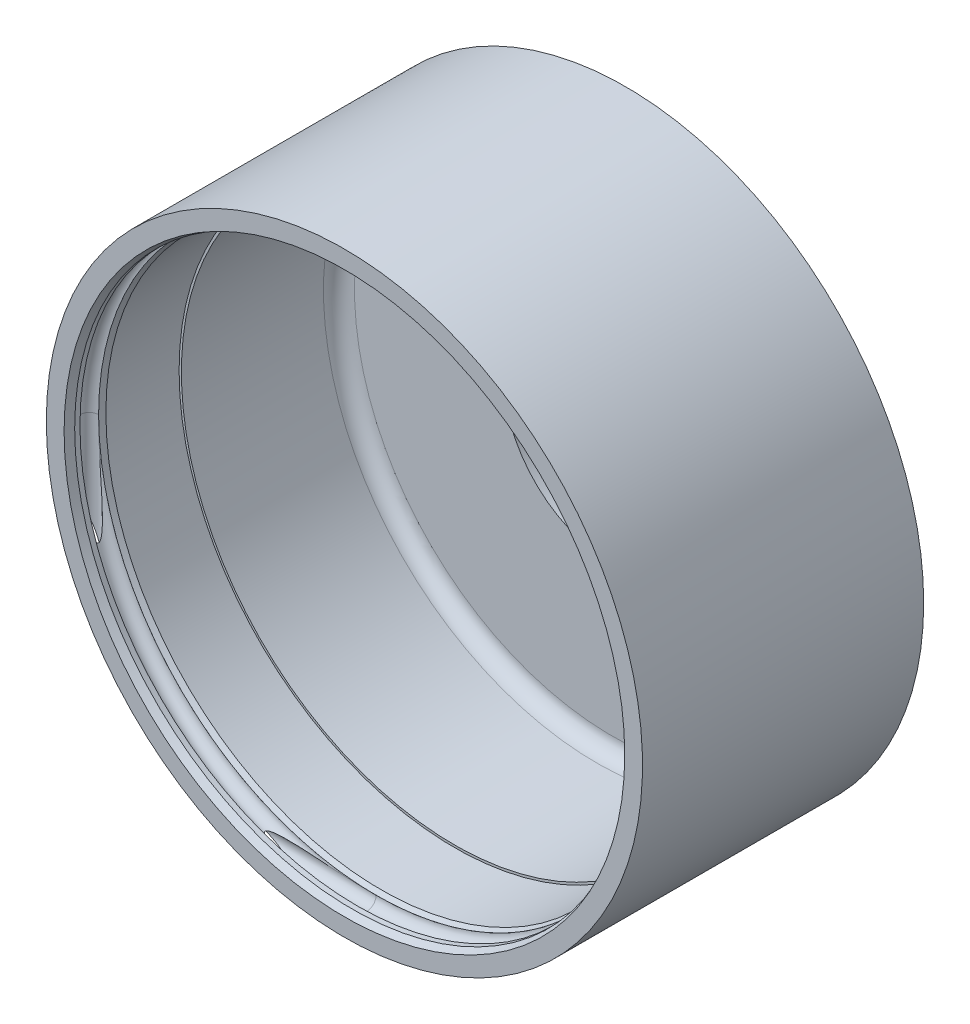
ISO-10303-21;
HEADER;
FILE_DESCRIPTION(('STEP AP214'),'2;1');
FILE_NAME('part.step','',(''),(''),'','','');
FILE_SCHEMA(('AUTOMOTIVE_DESIGN { 1 0 10303 214 1 1 1 1 }'));
ENDSEC;
DATA;
#1=APPLICATION_CONTEXT('core data for automotive mechanical design processes');
#2=APPLICATION_PROTOCOL_DEFINITION('international standard','automotive_design',2000,#1);
#3=PRODUCT_CONTEXT('',#1,'mechanical');
#4=PRODUCT('Part','Part','',(#3));
#5=PRODUCT_RELATED_PRODUCT_CATEGORY('part','',(#4));
#6=PRODUCT_DEFINITION_FORMATION('','',#4);
#7=PRODUCT_DEFINITION_CONTEXT('part definition',#1,'design');
#8=PRODUCT_DEFINITION('design','',#6,#7);
#9=PRODUCT_DEFINITION_SHAPE('','',#8);
#10=(LENGTH_UNIT() NAMED_UNIT(*) SI_UNIT(.MILLI.,.METRE.));
#11=(NAMED_UNIT(*) PLANE_ANGLE_UNIT() SI_UNIT($,.RADIAN.));
#12=(NAMED_UNIT(*) SI_UNIT($,.STERADIAN.) SOLID_ANGLE_UNIT());
#13=UNCERTAINTY_MEASURE_WITH_UNIT(LENGTH_MEASURE(1.E-05),#10,'distance_accuracy_value','');
#14=(GEOMETRIC_REPRESENTATION_CONTEXT(3) GLOBAL_UNCERTAINTY_ASSIGNED_CONTEXT((#13)) GLOBAL_UNIT_ASSIGNED_CONTEXT((#10,
#11,#12)) REPRESENTATION_CONTEXT('',''));
#15=CARTESIAN_POINT('',(0.,0.,0.));
#16=DIRECTION('',(0.,0.,1.));
#17=DIRECTION('',(1.,0.,0.));
#18=AXIS2_PLACEMENT_3D('',#15,#16,#17);
#19=CARTESIAN_POINT('',(0.,0.,64.48425));
#20=DIRECTION('',(0.,0.,1.));
#21=DIRECTION('',(1.,0.,0.));
#22=AXIS2_PLACEMENT_3D('',#19,#20,#21);
#23=TOROIDAL_SURFACE('',#22,56.746775,1.905);
#24=CARTESIAN_POINT('',(-56.746775,0.,66.38925));
#25=CARTESIAN_POINT('',(-56.7467750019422,-0.112296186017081,66.3892499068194));
#26=CARTESIAN_POINT('',(-56.7466083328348,-0.224592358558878,66.3892499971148));
#27=CARTESIAN_POINT('',(-56.745928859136,-0.453498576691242,66.3892498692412));
#28=CARTESIAN_POINT('',(-56.7454030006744,-0.570108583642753,66.3892496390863));
#29=CARTESIAN_POINT('',(-56.7439790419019,-0.805445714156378,66.3892480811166));
#30=CARTESIAN_POINT('',(-56.7430743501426,-0.924172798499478,66.3892467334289));
#31=CARTESIAN_POINT('',(-56.7413993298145,-1.10645723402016,66.3892424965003));
#32=CARTESIAN_POINT('',(-56.7407618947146,-1.17001585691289,66.3892406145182));
#33=CARTESIAN_POINT('',(-56.7373077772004,-1.48780766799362,66.3892285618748));
#34=CARTESIAN_POINT('',(-56.733690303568,-1.74203291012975,66.3892104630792));
#35=CARTESIAN_POINT('',(-56.7261391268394,-2.17134489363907,66.3891406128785));
#36=CARTESIAN_POINT('',(-56.7226541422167,-2.34643984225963,66.3891010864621));
#37=CARTESIAN_POINT('',(-56.7109838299,-2.87171832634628,66.3889299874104));
#38=CARTESIAN_POINT('',(-56.7015833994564,-3.22187577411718,66.3887458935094));
#39=CARTESIAN_POINT('',(-56.6795457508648,-3.92208428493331,66.3880951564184));
#40=CARTESIAN_POINT('',(-56.6669085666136,-4.2721353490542,66.3876285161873));
#41=CARTESIAN_POINT('',(-56.6400336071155,-4.93203460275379,66.3862992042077));
#42=CARTESIAN_POINT('',(-56.6261447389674,-5.24189709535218,66.385487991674));
#43=CARTESIAN_POINT('',(-56.5958352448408,-5.86151594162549,66.3833211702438));
#44=CARTESIAN_POINT('',(-56.5794144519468,-6.17127228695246,66.3819655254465));
#45=CARTESIAN_POINT('',(-56.5263292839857,-7.10088913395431,66.3767900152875));
#46=CARTESIAN_POINT('',(-56.4858651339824,-7.72053252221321,66.3718620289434));
#47=CARTESIAN_POINT('',(-56.3948557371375,-8.9590542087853,66.3570289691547));
#48=CARTESIAN_POINT('',(-56.3443099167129,-9.57793246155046,66.3471236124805));
#49=CARTESIAN_POINT('',(-56.2332025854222,-10.8146492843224,66.3196158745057));
#50=CARTESIAN_POINT('',(-56.172640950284,-11.4324878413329,66.302013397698));
#51=CARTESIAN_POINT('',(-56.0743693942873,-12.3580988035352,66.2669697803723));
#52=CARTESIAN_POINT('',(-56.0403754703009,-12.6664328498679,66.2538492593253));
#53=CARTESIAN_POINT('',(-55.969929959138,-13.2826474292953,66.2240788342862));
#54=CARTESIAN_POINT('',(-55.9334784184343,-13.5905279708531,66.2074289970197));
#55=CARTESIAN_POINT('',(-55.8581332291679,-14.2058045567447,66.1698106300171));
#56=CARTESIAN_POINT('',(-55.8192389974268,-14.5132004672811,66.1488410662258));
#57=CARTESIAN_POINT('',(-55.7390488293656,-15.12729711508,66.1015578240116));
#58=CARTESIAN_POINT('',(-55.6977527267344,-15.4339978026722,66.0752437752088));
#59=CARTESIAN_POINT('',(-55.6128119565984,-16.0464566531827,66.0158633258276));
#60=CARTESIAN_POINT('',(-55.5691670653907,-16.3522147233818,65.9827962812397));
#61=CARTESIAN_POINT('',(-55.4796241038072,-16.9623081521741,65.907903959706));
#62=CARTESIAN_POINT('',(-55.4337264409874,-17.2666437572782,65.8660802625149));
#63=CARTESIAN_POINT('',(-55.3632847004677,-17.7216679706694,65.7942463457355));
#64=CARTESIAN_POINT('',(-55.3395224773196,-17.8731929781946,65.768766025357));
#65=CARTESIAN_POINT('',(-55.2915074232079,-18.1755278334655,65.7141083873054));
#66=CARTESIAN_POINT('',(-55.2672545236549,-18.3263375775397,65.6849305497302));
#67=CARTESIAN_POINT('',(-55.2183346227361,-18.6268303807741,65.6220030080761));
#68=CARTESIAN_POINT('',(-55.1936679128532,-18.7765141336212,65.5882564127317));
#69=CARTESIAN_POINT('',(-55.1440025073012,-19.0743498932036,65.5148452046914));
#70=CARTESIAN_POINT('',(-55.1190039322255,-19.2225024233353,65.4751826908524));
#71=CARTESIAN_POINT('',(-55.0813675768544,-19.4430303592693,65.4094921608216));
#72=CARTESIAN_POINT('',(-55.0687863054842,-19.5163291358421,65.3865362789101));
#73=CARTESIAN_POINT('',(-55.0436285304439,-19.6620849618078,65.3381029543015));
#74=CARTESIAN_POINT('',(-55.031052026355,-19.734542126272,65.3126258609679));
#75=CARTESIAN_POINT('',(-55.0059381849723,-19.8784477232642,65.2584640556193));
#76=CARTESIAN_POINT('',(-54.9934009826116,-19.9498937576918,65.2297728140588));
#77=CARTESIAN_POINT('',(-54.9685129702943,-20.0909809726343,65.1682889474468));
#78=CARTESIAN_POINT('',(-54.9561620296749,-20.1606234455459,65.1354993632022));
#79=CARTESIAN_POINT('',(-54.9317341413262,-20.297673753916,65.0640005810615));
#80=CARTESIAN_POINT('',(-54.9196599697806,-20.365060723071,65.0252485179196));
#81=CARTESIAN_POINT('',(-54.9022291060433,-20.4618955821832,64.9608597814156));
#82=CARTESIAN_POINT('',(-54.8965453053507,-20.4933943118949,64.9384159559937));
#83=CARTESIAN_POINT('',(-54.8855186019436,-20.5543696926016,64.8908807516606));
#84=CARTESIAN_POINT('',(-54.8801752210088,-20.583849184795,64.8657932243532));
#85=CARTESIAN_POINT('',(-54.8716022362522,-20.6310543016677,64.8205586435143));
#86=CARTESIAN_POINT('',(-54.8682309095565,-20.6495903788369,64.8012913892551));
#87=CARTESIAN_POINT('',(-54.8618511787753,-20.684624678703,64.7608493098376));
#88=CARTESIAN_POINT('',(-54.8588432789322,-20.701120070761,64.7396719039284));
#89=CARTESIAN_POINT('',(-54.853325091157,-20.7313514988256,64.6949322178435));
#90=CARTESIAN_POINT('',(-54.8508214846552,-20.7450505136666,64.6713434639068));
#91=CARTESIAN_POINT('',(-54.8466074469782,-20.7680922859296,64.6220640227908));
#92=CARTESIAN_POINT('',(-54.8448944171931,-20.777449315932,64.5963805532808));
#93=CARTESIAN_POINT('',(-54.8428392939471,-20.7886716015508,64.5507640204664));
#94=CARTESIAN_POINT('',(-54.8422505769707,-20.7918848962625,64.53117579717));
#95=CARTESIAN_POINT('',(-54.8416878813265,-20.7949561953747,64.491729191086));
#96=CARTESIAN_POINT('',(-54.8417135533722,-20.7948161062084,64.4718709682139));
#97=CARTESIAN_POINT('',(-54.8423759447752,-20.7912005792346,64.4325144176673));
#98=CARTESIAN_POINT('',(-54.8430116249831,-20.7877308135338,64.4130155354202));
#99=CARTESIAN_POINT('',(-54.8448245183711,-20.7778306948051,64.3748133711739));
#100=CARTESIAN_POINT('',(-54.8460022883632,-20.7713972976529,64.3561109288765));
#101=CARTESIAN_POINT('',(-54.8494894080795,-20.7523367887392,64.3108364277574));
#102=CARTESIAN_POINT('',(-54.8520704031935,-20.7382196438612,64.2849182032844));
#103=CARTESIAN_POINT('',(-54.8579086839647,-20.7062441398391,64.2355961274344));
#104=CARTESIAN_POINT('',(-54.8611678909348,-20.6883751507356,64.2121997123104));
#105=CARTESIAN_POINT('',(-54.8712080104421,-20.6332447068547,64.1479579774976));
#106=CARTESIAN_POINT('',(-54.878555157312,-20.5928042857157,64.109971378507));
#107=CARTESIAN_POINT('',(-54.8940164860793,-20.5074167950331,64.0397368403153));
#108=CARTESIAN_POINT('',(-54.9021330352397,-20.4624557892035,64.0075075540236));
#109=CARTESIAN_POINT('',(-54.9245246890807,-20.3379789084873,63.9263469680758));
#110=CARTESIAN_POINT('',(-54.9391801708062,-20.2560519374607,63.8812617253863));
#111=CARTESIAN_POINT('',(-54.9689503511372,-20.0885628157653,63.7984919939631));
#112=CARTESIAN_POINT('',(-54.9840661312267,-20.0029918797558,63.7608267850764));
#113=CARTESIAN_POINT('',(-55.0145484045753,-19.8292881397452,63.6905950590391));
#114=CARTESIAN_POINT('',(-55.0299158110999,-19.7411439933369,63.6580571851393));
#115=CARTESIAN_POINT('',(-55.0606539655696,-19.5636295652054,63.5970177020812));
#116=CARTESIAN_POINT('',(-55.0760246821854,-19.4742610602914,63.5685108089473));
#117=CARTESIAN_POINT('',(-55.1093862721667,-19.2789326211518,63.5099241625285));
#118=CARTESIAN_POINT('',(-55.127367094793,-19.1727946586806,63.4804356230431));
#119=CARTESIAN_POINT('',(-55.1631815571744,-18.9596059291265,63.4248430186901));
#120=CARTESIAN_POINT('',(-55.1810151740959,-18.852555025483,63.3987394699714));
#121=CARTESIAN_POINT('',(-55.2342407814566,-18.5302965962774,63.3245070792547));
#122=CARTESIAN_POINT('',(-55.2693385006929,-18.314094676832,63.2804882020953));
#123=CARTESIAN_POINT('',(-55.3386224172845,-17.8795925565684,63.2001461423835));
#124=CARTESIAN_POINT('',(-55.3728061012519,-17.6612884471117,63.1638425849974));
#125=CARTESIAN_POINT('',(-55.4400617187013,-17.2236731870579,63.0972521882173));
#126=CARTESIAN_POINT('',(-55.4731339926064,-17.0043623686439,63.0669634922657));
#127=CARTESIAN_POINT('',(-55.5381107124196,-16.5650070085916,63.0111627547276));
#128=CARTESIAN_POINT('',(-55.5700153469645,-16.3449625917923,62.9856499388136));
#129=CARTESIAN_POINT('',(-55.632626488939,-15.904273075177,62.9385373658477));
#130=CARTESIAN_POINT('',(-55.6633329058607,-15.6836279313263,62.9169379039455));
#131=CARTESIAN_POINT('',(-55.7535290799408,-15.0216038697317,62.8570675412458));
#132=CARTESIAN_POINT('',(-55.8111847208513,-14.5795350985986,62.8236523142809));
#133=CARTESIAN_POINT('',(-55.9273735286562,-13.6467511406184,62.7631109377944));
#134=CARTESIAN_POINT('',(-55.9853385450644,-13.1558998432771,62.737042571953));
#135=CARTESIAN_POINT('',(-56.0950234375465,-12.1729552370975,62.6932375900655));
#136=CARTESIAN_POINT('',(-56.1467409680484,-11.6808615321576,62.6755040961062));
#137=CARTESIAN_POINT('',(-56.2437704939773,-10.6966056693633,62.6461608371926));
#138=CARTESIAN_POINT('',(-56.2890918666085,-10.2044446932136,62.6345420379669));
#139=CARTESIAN_POINT('',(-56.3733719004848,-9.21955355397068,62.6157062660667));
#140=CARTESIAN_POINT('',(-56.4123312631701,-8.72682345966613,62.6084888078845));
#141=CARTESIAN_POINT('',(-56.4912975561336,-7.63836824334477,62.5959507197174));
#142=CARTESIAN_POINT('',(-56.5298381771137,-7.04252865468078,62.5913364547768));
#143=CARTESIAN_POINT('',(-56.5975637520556,-5.85017383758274,62.5847981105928));
#144=CARTESIAN_POINT('',(-56.6267466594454,-5.25365848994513,62.5828746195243));
#145=CARTESIAN_POINT('',(-56.6655563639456,-4.30783847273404,62.5809295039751));
#146=CARTESIAN_POINT('',(-56.6782732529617,-3.95865856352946,62.5804498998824));
#147=CARTESIAN_POINT('',(-56.700485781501,-3.26021509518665,62.5797797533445));
#148=CARTESIAN_POINT('',(-56.7099816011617,-2.91095154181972,62.5795891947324));
#149=CARTESIAN_POINT('',(-56.7267807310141,-2.16666823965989,62.5793338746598));
#150=CARTESIAN_POINT('',(-56.7336348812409,-1.7716382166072,62.5792888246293));
#151=CARTESIAN_POINT('',(-56.7410563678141,-1.15976978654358,62.5792570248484));
#152=CARTESIAN_POINT('',(-56.7430649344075,-0.942947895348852,62.5792531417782));
#153=CARTESIAN_POINT('',(-56.7452822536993,-0.596378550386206,62.5792503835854));
#154=CARTESIAN_POINT('',(-56.7458898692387,-0.466633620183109,62.5792501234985));
#155=CARTESIAN_POINT('',(-56.7466083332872,-0.224592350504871,62.5792500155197));
#156=CARTESIAN_POINT('',(-56.7467750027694,-0.112296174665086,62.579250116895));
#157=CARTESIAN_POINT('',(-56.746775,0.,62.57925));
#158=B_SPLINE_CURVE_WITH_KNOTS('',3,(#24,#25,#26,#27,#28,#29,#30,#31,#32,#33,#34,#35,#36,#37,
#38,#39,#40,#41,#42,#43,#44,#45,#46,#47,#48,#49,#50,#51,#52,#53,#54,#55,#56,#57,#58,#59,#60,#61,
#62,#63,#64,#65,#66,#67,#68,#69,#70,#71,#72,#73,#74,#75,#76,#77,#78,#79,#80,#81,#82,#83,#84,#85,
#86,#87,#88,#89,#90,#91,#92,#93,#94,#95,#96,#97,#98,#99,#100,#101,#102,#103,#104,#105,#106,#107,
#108,#109,#110,#111,#112,#113,#114,#115,#116,#117,#118,#119,#120,#121,#122,#123,#124,#125,#126,
#127,#128,#129,#130,#131,#132,#133,#134,#135,#136,#137,#138,#139,#140,#141,#142,#143,#144,#145,
#146,#147,#148,#149,#150,#151,#152,#153,#154,#155,#156,#157),.UNSPECIFIED.,.F.,.F.,(4,2,2,2,2,2,
2,2,2,2,2,2,2,2,2,2,2,2,2,2,2,2,2,2,2,2,2,2,2,2,2,2,2,2,2,2,2,2,2,2,2,2,2,2,2,2,2,2,2,2,2,2,2,2,
2,2,2,2,2,2,2,2,2,2,2,2,4),(0.,0.336888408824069,0.686721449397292,1.04291236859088,
1.23359780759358,1.99634359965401,2.52173120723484,3.57256560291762,4.62338899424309,
5.55390180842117,6.48447599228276,8.34732032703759,10.2102706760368,12.07324414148,
13.0046594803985,13.9360572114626,14.8676781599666,15.7993636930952,16.7311381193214,
17.6627445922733,18.1291470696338,18.5956152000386,19.0617675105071,19.5277548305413,
19.7612190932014,19.9946510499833,20.2285661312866,20.462308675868,20.6978177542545,
20.8149999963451,20.9320138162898,21.0127485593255,21.0935940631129,21.1754489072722,
21.2570327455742,21.3163388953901,21.3756113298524,21.4347829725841,21.4940155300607,
21.5823820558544,21.6710024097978,21.8379642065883,22.0054574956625,22.2886782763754,
22.5726255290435,22.8581067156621,23.1432101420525,23.4779835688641,23.812807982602,
24.4828082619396,25.1544929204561,25.8259699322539,26.4973379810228,27.1687566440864,
28.5097587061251,29.9944755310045,31.4797480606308,32.9628199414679,34.4457281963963,
36.2369507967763,38.0285648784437,39.0767868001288,40.124950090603,41.3101950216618,
41.9606854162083,42.3499237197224,42.6868121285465),.UNSPECIFIED.);
#159=CARTESIAN_POINT('',(-56.746775,0.,66.38925));
#160=VERTEX_POINT('',#159);
#161=CARTESIAN_POINT('',(-56.746775,0.,62.57925));
#162=VERTEX_POINT('',#161);
#163=EDGE_CURVE('E53',#160,#162,#158,.T.);
#164=ORIENTED_EDGE('',*,*,#163,.F.);
#165=CARTESIAN_POINT('',(0.,0.,66.38925));
#166=DIRECTION('',(0.,0.,1.));
#167=DIRECTION('',(1.,0.,0.));
#168=AXIS2_PLACEMENT_3D('',#165,#166,#167);
#169=CIRCLE('',#168,56.746775);
#170=CARTESIAN_POINT('',(0.,-56.746775,66.38925));
#171=VERTEX_POINT('',#170);
#172=EDGE_CURVE('E60',#160,#171,#169,.T.);
#173=ORIENTED_EDGE('',*,*,#172,.T.);
#174=CARTESIAN_POINT('',(0.,-56.746775,66.38925));
#175=CARTESIAN_POINT('',(-0.112296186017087,-56.7467750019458,66.3892499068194));
#176=CARTESIAN_POINT('',(-0.224592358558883,-56.746608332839,66.3892499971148));
#177=CARTESIAN_POINT('',(-0.45349857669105,-56.7459288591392,66.3892498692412));
#178=CARTESIAN_POINT('',(-0.570108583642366,-56.745403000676,66.3892496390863));
#179=CARTESIAN_POINT('',(-0.805445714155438,-56.743979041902,66.3892480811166));
#180=CARTESIAN_POINT('',(-0.924172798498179,-56.7430743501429,66.3892467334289));
#181=CARTESIAN_POINT('',(-1.10645723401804,-56.7413993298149,66.3892424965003));
#182=CARTESIAN_POINT('',(-1.17001585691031,-56.740761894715,66.3892406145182));
#183=CARTESIAN_POINT('',(-1.48780766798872,-56.7373077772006,66.3892285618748));
#184=CARTESIAN_POINT('',(-1.74203291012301,-56.7336903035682,66.3892104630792));
#185=CARTESIAN_POINT('',(-2.17134489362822,-56.7261391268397,66.3891406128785));
#186=CARTESIAN_POINT('',(-2.3464398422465,-56.722654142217,66.3891010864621));
#187=CARTESIAN_POINT('',(-2.87171832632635,-56.7109838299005,66.3889299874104));
#188=CARTESIAN_POINT('',(-3.22187577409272,-56.7015833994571,66.3887458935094));
#189=CARTESIAN_POINT('',(-3.92208428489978,-56.679545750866,66.3880951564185));
#190=CARTESIAN_POINT('',(-4.27213534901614,-56.666908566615,66.3876285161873));
#191=CARTESIAN_POINT('',(-4.93203460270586,-56.6400336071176,66.3862992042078));
#192=CARTESIAN_POINT('',(-5.24189709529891,-56.6261447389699,66.3854879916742));
#193=CARTESIAN_POINT('',(-5.86151594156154,-56.5958352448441,66.3833211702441));
#194=CARTESIAN_POINT('',(-6.17127228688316,-56.5794144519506,66.3819655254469));
#195=CARTESIAN_POINT('',(-7.10088913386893,-56.526329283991,66.3767900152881));
#196=CARTESIAN_POINT('',(-7.72053252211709,-56.4858651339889,66.3718620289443));
#197=CARTESIAN_POINT('',(-8.95905420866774,-56.3948557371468,66.3570289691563));
#198=CARTESIAN_POINT('',(-9.5779324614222,-56.3443099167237,66.3471236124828));
#199=CARTESIAN_POINT('',(-10.8146492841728,-56.2332025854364,66.3196158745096));
#200=CARTESIAN_POINT('',(-11.4324878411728,-56.1726409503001,66.302013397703));
#201=CARTESIAN_POINT('',(-12.3580988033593,-56.0743693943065,66.2669697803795));
#202=CARTESIAN_POINT('',(-12.6664328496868,-56.0403754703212,66.2538492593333));
#203=CARTESIAN_POINT('',(-13.2826474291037,-55.9699299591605,66.2240788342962));
#204=CARTESIAN_POINT('',(-13.5905279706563,-55.9334784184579,66.2074289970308));
#205=CARTESIAN_POINT('',(-14.2058045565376,-55.8581332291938,66.1698106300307));
#206=CARTESIAN_POINT('',(-14.5132004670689,-55.8192389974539,66.1488410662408));
#207=CARTESIAN_POINT('',(-15.1272971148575,-55.7390488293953,66.10155782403));
#208=CARTESIAN_POINT('',(-15.4339978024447,-55.6977527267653,66.0752437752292));
#209=CARTESIAN_POINT('',(-16.046456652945,-55.612811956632,66.0158633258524));
#210=CARTESIAN_POINT('',(-16.352214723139,-55.5691670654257,65.982796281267));
#211=CARTESIAN_POINT('',(-16.9623081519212,-55.479624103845,65.9079039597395));
#212=CARTESIAN_POINT('',(-17.2666437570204,-55.4337264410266,65.8660802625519));
#213=CARTESIAN_POINT('',(-17.7216679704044,-55.363284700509,65.7942463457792));
#214=CARTESIAN_POINT('',(-17.8731929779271,-55.3395224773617,65.7687660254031));
#215=CARTESIAN_POINT('',(-18.1755278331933,-55.2915074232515,65.7141083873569));
#216=CARTESIAN_POINT('',(-18.3263375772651,-55.2672545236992,65.6849305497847));
#217=CARTESIAN_POINT('',(-18.6268303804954,-55.2183346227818,65.6220030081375));
#218=CARTESIAN_POINT('',(-18.7765141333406,-55.1936679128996,65.5882564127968));
#219=CARTESIAN_POINT('',(-19.0743498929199,-55.1440025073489,65.5148452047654));
#220=CARTESIAN_POINT('',(-19.2225024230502,-55.1190039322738,65.4751826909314));
#221=CARTESIAN_POINT('',(-19.4430303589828,-55.0813675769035,65.4094921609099));
#222=CARTESIAN_POINT('',(-19.5163291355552,-55.0687863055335,65.3865362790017));
#223=CARTESIAN_POINT('',(-19.6620849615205,-55.0436285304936,65.3381029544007));
#224=CARTESIAN_POINT('',(-19.7345421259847,-55.031052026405,65.3126258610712));
#225=CARTESIAN_POINT('',(-19.8784477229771,-55.0059381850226,65.2584640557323));
#226=CARTESIAN_POINT('',(-19.9498937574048,-54.993400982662,65.2297728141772));
#227=CARTESIAN_POINT('',(-20.0909809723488,-54.9685129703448,65.1682889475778));
#228=CARTESIAN_POINT('',(-20.1606234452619,-54.9561620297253,65.1354993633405));
#229=CARTESIAN_POINT('',(-20.2976737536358,-54.9317341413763,65.0640005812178));
#230=CARTESIAN_POINT('',(-20.3650607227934,-54.9196599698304,65.0252485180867));
#231=CARTESIAN_POINT('',(-20.461895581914,-54.9022291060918,64.9608597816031));
#232=CARTESIAN_POINT('',(-20.4933943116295,-54.8965453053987,64.9384159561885));
#233=CARTESIAN_POINT('',(-20.5543696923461,-54.8855186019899,64.8908807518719));
#234=CARTESIAN_POINT('',(-20.5838491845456,-54.880175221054,64.8657932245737));
#235=CARTESIAN_POINT('',(-20.6310543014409,-54.8716022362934,64.8205586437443));
#236=CARTESIAN_POINT('',(-20.6495903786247,-54.8682309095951,64.801291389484));
#237=CARTESIAN_POINT('',(-20.6846246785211,-54.8618511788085,64.7608493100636));
#238=CARTESIAN_POINT('',(-20.7011200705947,-54.8588432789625,64.7396719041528));
#239=CARTESIAN_POINT('',(-20.7313514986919,-54.8533250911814,64.6949322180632));
#240=CARTESIAN_POINT('',(-20.7450505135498,-54.8508214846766,64.6713434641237));
#241=CARTESIAN_POINT('',(-20.7680922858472,-54.8466074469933,64.6220640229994));
#242=CARTESIAN_POINT('',(-20.7774493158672,-54.844894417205,64.596380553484));
#243=CARTESIAN_POINT('',(-20.788671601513,-54.8428392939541,64.5507640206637));
#244=CARTESIAN_POINT('',(-20.7918848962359,-54.8422505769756,64.5311757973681));
#245=CARTESIAN_POINT('',(-20.7949561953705,-54.8416878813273,64.4917291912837));
#246=CARTESIAN_POINT('',(-20.7948161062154,-54.8417135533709,64.4718709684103));
#247=CARTESIAN_POINT('',(-20.7912005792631,-54.8423759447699,64.4325144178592));
#248=CARTESIAN_POINT('',(-20.7877308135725,-54.843011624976,64.4130155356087));
#249=CARTESIAN_POINT('',(-20.7778306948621,-54.8448245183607,64.3748133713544));
#250=CARTESIAN_POINT('',(-20.7713972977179,-54.8460022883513,64.3561109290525));
#251=CARTESIAN_POINT('',(-20.75233678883,-54.8494894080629,64.3108364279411));
#252=CARTESIAN_POINT('',(-20.7382196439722,-54.8520704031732,64.2849182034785));
#253=CARTESIAN_POINT('',(-20.7062441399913,-54.8579086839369,64.2355961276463));
#254=CARTESIAN_POINT('',(-20.6883751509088,-54.8611678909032,64.2121997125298));
#255=CARTESIAN_POINT('',(-20.6332447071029,-54.8712080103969,64.1479579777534));
#256=CARTESIAN_POINT('',(-20.5928042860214,-54.8785551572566,64.1099713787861));
#257=CARTESIAN_POINT('',(-20.5074167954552,-54.894016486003,64.039736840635));
#258=CARTESIAN_POINT('',(-20.4624557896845,-54.9021330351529,64.0075075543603));
#259=CARTESIAN_POINT('',(-20.3379789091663,-54.9245246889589,63.926346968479));
#260=CARTESIAN_POINT('',(-20.2560519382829,-54.9391801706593,63.8812617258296));
#261=CARTESIAN_POINT('',(-20.0885628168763,-54.9689503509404,63.7984919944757));
#262=CARTESIAN_POINT('',(-20.0029918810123,-54.9840661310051,63.7608267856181));
#263=CARTESIAN_POINT('',(-19.8292881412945,-55.0145484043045,63.6905950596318));
#264=CARTESIAN_POINT('',(-19.7411439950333,-55.0299158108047,63.6580571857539));
#265=CARTESIAN_POINT('',(-19.5636295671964,-55.0606539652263,63.5970177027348));
#266=CARTESIAN_POINT('',(-19.4742610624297,-55.0760246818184,63.5685108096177));
#267=CARTESIAN_POINT('',(-19.2789326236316,-55.1093862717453,63.5099241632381));
#268=CARTESIAN_POINT('',(-19.1727946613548,-55.1273670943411,63.4804356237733));
#269=CARTESIAN_POINT('',(-18.9596059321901,-55.1631815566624,63.4248430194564));
#270=CARTESIAN_POINT('',(-18.8525550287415,-55.1810151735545,63.3987394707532));
#271=CARTESIAN_POINT('',(-18.5302966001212,-55.2342407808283,63.3245070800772));
#272=CARTESIAN_POINT('',(-18.3140946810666,-55.2693385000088,63.2804882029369));
#273=CARTESIAN_POINT('',(-17.8795925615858,-55.3386224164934,63.200146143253));
#274=CARTESIAN_POINT('',(-17.6612884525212,-55.3728061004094,63.1638425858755));
#275=CARTESIAN_POINT('',(-17.2236731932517,-55.4400617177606,63.0972521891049));
#276=CARTESIAN_POINT('',(-17.00436237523,-55.4731339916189,63.0669634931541));
#277=CARTESIAN_POINT('',(-16.5650070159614,-55.5381107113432,63.0111627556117));
#278=CARTESIAN_POINT('',(-16.3449625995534,-55.570015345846,62.9856499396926));
#279=CARTESIAN_POINT('',(-15.9042730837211,-55.6326264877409,62.9385373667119));
#280=CARTESIAN_POINT('',(-15.683627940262,-55.6633329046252,62.9169379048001));
#281=CARTESIAN_POINT('',(-15.0216038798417,-55.7535290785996,62.8570675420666));
#282=CARTESIAN_POINT('',(-14.5795351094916,-55.8111847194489,62.8236523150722));
#283=CARTESIAN_POINT('',(-13.6467511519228,-55.9273735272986,62.7631109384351));
#284=CARTESIAN_POINT('',(-13.1558998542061,-55.9853385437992,62.7370425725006));
#285=CARTESIAN_POINT('',(-12.1729552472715,-56.0950234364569,62.6932375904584));
#286=CARTESIAN_POINT('',(-11.6808615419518,-56.146740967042,62.6755040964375));
#287=CARTESIAN_POINT('',(-10.6966056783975,-56.2437704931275,62.6461608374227));
#288=CARTESIAN_POINT('',(-10.2044447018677,-56.2890918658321,62.6345420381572));
#289=CARTESIAN_POINT('',(-9.21955356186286,-56.3733718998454,62.6157062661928));
#290=CARTESIAN_POINT('',(-8.72682346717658,-56.4123312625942,62.608488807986));
#291=CARTESIAN_POINT('',(-7.63836824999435,-56.4912975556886,62.5959507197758));
#292=CARTESIAN_POINT('',(-7.04252866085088,-56.5298381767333,62.5913364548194));
#293=CARTESIAN_POINT('',(-5.85017384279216,-56.5975637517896,62.5847981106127));
#294=CARTESIAN_POINT('',(-5.25365849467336,-56.626746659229,62.5828746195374));
#295=CARTESIAN_POINT('',(-4.30783847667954,-56.6655563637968,62.5809295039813));
#296=CARTESIAN_POINT('',(-3.95865856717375,-56.6782732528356,62.5804498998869));
#297=CARTESIAN_POINT('',(-3.26021509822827,-56.7004857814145,62.5797797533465));
#298=CARTESIAN_POINT('',(-2.91095154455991,-56.7099816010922,62.5795891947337));
#299=CARTESIAN_POINT('',(-2.1666682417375,-56.7267807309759,62.5793338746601));
#300=CARTESIAN_POINT('',(-1.77163821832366,-56.7336348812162,62.5792888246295));
#301=CARTESIAN_POINT('',(-1.15976978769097,-56.7410563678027,62.5792570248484));
#302=CARTESIAN_POINT('',(-0.942947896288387,-56.7430649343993,62.5792531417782));
#303=CARTESIAN_POINT('',(-0.596378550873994,-56.7452822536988,62.5792503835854));
#304=CARTESIAN_POINT('',(-0.466633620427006,-56.7458898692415,62.5792501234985));
#305=CARTESIAN_POINT('',(-0.224592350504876,-56.7466083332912,62.5792500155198));
#306=CARTESIAN_POINT('',(-0.112296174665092,-56.7467750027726,62.579250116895));
#307=CARTESIAN_POINT('',(0.,-56.746775,62.57925));
#308=B_SPLINE_CURVE_WITH_KNOTS('',3,(#174,#175,#176,#177,#178,#179,#180,#181,#182,#183,#184,
#185,#186,#187,#188,#189,#190,#191,#192,#193,#194,#195,#196,#197,#198,#199,#200,#201,#202,#203,
#204,#205,#206,#207,#208,#209,#210,#211,#212,#213,#214,#215,#216,#217,#218,#219,#220,#221,#222,
#223,#224,#225,#226,#227,#228,#229,#230,#231,#232,#233,#234,#235,#236,#237,#238,#239,#240,#241,
#242,#243,#244,#245,#246,#247,#248,#249,#250,#251,#252,#253,#254,#255,#256,#257,#258,#259,#260,
#261,#262,#263,#264,#265,#266,#267,#268,#269,#270,#271,#272,#273,#274,#275,#276,#277,#278,#279,
#280,#281,#282,#283,#284,#285,#286,#287,#288,#289,#290,#291,#292,#293,#294,#295,#296,#297,#298,
#299,#300,#301,#302,#303,#304,#305,#306,#307),.UNSPECIFIED.,.F.,.F.,(4,2,2,2,2,2,2,2,2,2,2,2,2,
2,2,2,2,2,2,2,2,2,2,2,2,2,2,2,2,2,2,2,2,2,2,2,2,2,2,2,2,2,2,2,2,2,2,2,2,2,2,2,2,2,2,2,2,2,2,2,2,
2,2,2,2,2,4),(0.,0.336888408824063,0.68672144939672,1.04291236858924,1.23359780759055,
1.99634359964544,2.52173120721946,3.57256560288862,4.62338899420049,5.55390180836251,
6.48447599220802,8.34732032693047,10.2102706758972,12.0732441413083,13.0046594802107,
13.9360572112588,14.8676781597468,15.7993636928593,16.731138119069,17.6627445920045,
18.1291470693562,18.5956151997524,19.0617675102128,19.527754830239,19.7612190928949,
19.9946510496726,20.2285661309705,20.4623086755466,20.6978177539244,20.8149999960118,
20.9320138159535,21.0127485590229,21.0935940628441,21.1754489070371,21.2570327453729,
21.3163388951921,21.3756113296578,21.4347829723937,21.4940155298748,21.5823820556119,
21.6710024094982,21.8379642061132,22.0054574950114,22.2886782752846,22.5726255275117,
22.8581067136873,23.1432101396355,23.4779835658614,23.8128079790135,24.4828082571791,
25.1544929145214,25.8259699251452,26.4973379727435,27.1687566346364,28.5097586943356,
29.9944755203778,31.4797480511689,32.962819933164,34.4457281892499,36.2369507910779,
38.0285648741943,39.0767867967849,40.1249500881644,41.3101950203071,41.9606854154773,
42.3499237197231,42.6868121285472),.UNSPECIFIED.);
#309=CARTESIAN_POINT('',(0.,-56.746775,62.57925));
#310=VERTEX_POINT('',#309);
#311=EDGE_CURVE('E222',#310,#171,#308,.F.);
#312=ORIENTED_EDGE('',*,*,#311,.F.);
#313=CARTESIAN_POINT('',(0.,0.,62.57925));
#314=DIRECTION('',(0.,0.,1.));
#315=DIRECTION('',(1.,0.,0.));
#316=AXIS2_PLACEMENT_3D('',#313,#314,#315);
#317=CIRCLE('',#316,56.746775);
#318=EDGE_CURVE('E86',#162,#310,#317,.T.);
#319=ORIENTED_EDGE('',*,*,#318,.F.);
#320=EDGE_LOOP('',(#164,#173,#312,#319));
#321=FACE_BOUND('',#320,.T.);
#322=ADVANCED_FACE('F39',(#321),#23,.F.);
#323=CARTESIAN_POINT('',(0.,60.96,69.05625));
#324=DIRECTION('',(0.,0.,-1.));
#325=DIRECTION('',(-1.,0.,0.));
#326=AXIS2_PLACEMENT_3D('',#323,#324,#325);
#327=PLANE('',#326);
#328=CARTESIAN_POINT('',(0.,0.,69.05625));
#329=DIRECTION('',(0.,0.,-1.));
#330=DIRECTION('',(-1.,0.,0.));
#331=AXIS2_PLACEMENT_3D('',#328,#329,#330);
#332=CIRCLE('',#331,60.96);
#333=CARTESIAN_POINT('',(-60.96,0.,69.05625));
#334=VERTEX_POINT('',#333);
#335=EDGE_CURVE('E115',#334,#334,#332,.T.);
#336=ORIENTED_EDGE('',*,*,#335,.F.);
#337=EDGE_LOOP('',(#336));
#338=FACE_BOUND('',#337,.T.);
#339=CARTESIAN_POINT('',(0.,0.,69.05625));
#340=DIRECTION('',(0.,0.,1.));
#341=DIRECTION('',(1.,0.,0.));
#342=AXIS2_PLACEMENT_3D('',#339,#340,#341);
#343=CIRCLE('',#342,57.3245777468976);
#344=CARTESIAN_POINT('',(57.3245777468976,0.,69.05625));
#345=VERTEX_POINT('',#344);
#346=EDGE_CURVE('E240',#345,#345,#343,.T.);
#347=ORIENTED_EDGE('',*,*,#346,.F.);
#348=EDGE_LOOP('',(#347));
#349=FACE_BOUND('',#348,.T.);
#350=ADVANCED_FACE('F143',(#338,#349),#327,.F.);
#351=CARTESIAN_POINT('',(0.,0.,19.05));
#352=DIRECTION('',(0.,0.,-1.));
#353=DIRECTION('',(-1.,0.,0.));
#354=AXIS2_PLACEMENT_3D('',#351,#352,#353);
#355=CYLINDRICAL_SURFACE('',#354,55.88);
#356=CARTESIAN_POINT('',(0.,0.,17.4625));
#357=DIRECTION('',(0.,0.,1.));
#358=DIRECTION('',(1.,0.,0.));
#359=AXIS2_PLACEMENT_3D('',#356,#357,#358);
#360=CIRCLE('',#359,55.88);
#361=CARTESIAN_POINT('',(55.88,0.,17.4625));
#362=VERTEX_POINT('',#361);
#363=EDGE_CURVE('E47',#362,#362,#360,.F.);
#364=ORIENTED_EDGE('',*,*,#363,.T.);
#365=EDGE_LOOP('',(#364));
#366=FACE_BOUND('',#365,.T.);
#367=CARTESIAN_POINT('',(0.,0.,46.51375));
#368=DIRECTION('',(0.,0.,1.));
#369=DIRECTION('',(1.,0.,0.));
#370=AXIS2_PLACEMENT_3D('',#367,#368,#369);
#371=CIRCLE('',#370,55.88);
#372=CARTESIAN_POINT('',(55.88,0.,46.51375));
#373=VERTEX_POINT('',#372);
#374=EDGE_CURVE('E114',#373,#373,#371,.F.);
#375=ORIENTED_EDGE('',*,*,#374,.F.);
#376=EDGE_LOOP('',(#375));
#377=FACE_BOUND('',#376,.T.);
#378=ADVANCED_FACE('F131',(#366,#377),#355,.F.);
#379=CARTESIAN_POINT('',(0.,0.,14.2875));
#380=DIRECTION('',(0.,0.,1.));
#381=DIRECTION('',(1.,0.,0.));
#382=AXIS2_PLACEMENT_3D('',#379,#380,#381);
#383=PLANE('',#382);
#384=CARTESIAN_POINT('',(0.,0.,14.2875));
#385=DIRECTION('',(0.,0.,1.));
#386=DIRECTION('',(1.,0.,0.));
#387=AXIS2_PLACEMENT_3D('',#384,#385,#386);
#388=CIRCLE('',#387,52.705);
#389=CARTESIAN_POINT('',(52.705,0.,14.2875));
#390=VERTEX_POINT('',#389);
#391=EDGE_CURVE('E12',#390,#390,#388,.T.);
#392=ORIENTED_EDGE('',*,*,#391,.T.);
#393=EDGE_LOOP('',(#392));
#394=FACE_BOUND('',#393,.T.);
#395=CARTESIAN_POINT('',(0.,0.,14.2875));
#396=DIRECTION('',(0.,0.,1.));
#397=DIRECTION('',(1.,0.,0.));
#398=AXIS2_PLACEMENT_3D('',#395,#396,#397);
#399=CIRCLE('',#398,22.225);
#400=CARTESIAN_POINT('',(22.225,0.,14.2875));
#401=VERTEX_POINT('',#400);
#402=EDGE_CURVE('E118',#401,#401,#399,.T.);
#403=ORIENTED_EDGE('',*,*,#402,.F.);
#404=EDGE_LOOP('',(#403));
#405=FACE_BOUND('',#404,.T.);
#406=ADVANCED_FACE('F180',(#394,#405),#383,.T.);
#407=CARTESIAN_POINT('',(0.,0.,0.));
#408=DIRECTION('',(0.,0.,1.));
#409=DIRECTION('',(1.,0.,0.));
#410=AXIS2_PLACEMENT_3D('',#407,#408,#409);
#411=PLANE('',#410);
#412=CARTESIAN_POINT('',(0.,0.,0.));
#413=DIRECTION('',(0.,0.,1.));
#414=DIRECTION('',(1.,0.,0.));
#415=AXIS2_PLACEMENT_3D('',#412,#413,#414);
#416=CIRCLE('',#415,44.45);
#417=CARTESIAN_POINT('',(44.45,0.,0.));
#418=VERTEX_POINT('',#417);
#419=EDGE_CURVE('E227',#418,#418,#416,.T.);
#420=ORIENTED_EDGE('',*,*,#419,.F.);
#421=EDGE_LOOP('',(#420));
#422=FACE_BOUND('',#421,.T.);
#423=CARTESIAN_POINT('',(-27.6584817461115,27.6584817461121,0.));
#424=DIRECTION('',(0.,0.,-1.));
#425=DIRECTION('',(0.,-1.,0.));
#426=AXIS2_PLACEMENT_3D('',#423,#424,#425);
#427=CIRCLE('',#426,2.49999999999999);
#428=CARTESIAN_POINT('',(-27.6584817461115,25.1584817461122,0.));
#429=VERTEX_POINT('',#428);
#430=EDGE_CURVE('E271',#429,#429,#427,.T.);
#431=ORIENTED_EDGE('',*,*,#430,.F.);
#432=EDGE_LOOP('',(#431));
#433=FACE_BOUND('',#432,.T.);
#434=CARTESIAN_POINT('',(-27.6584817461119,-27.6584817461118,0.));
#435=DIRECTION('',(0.,0.,-1.));
#436=DIRECTION('',(1.,0.,0.));
#437=AXIS2_PLACEMENT_3D('',#434,#435,#436);
#438=CIRCLE('',#437,2.49999999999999);
#439=CARTESIAN_POINT('',(-25.1584817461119,-27.6584817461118,0.));
#440=VERTEX_POINT('',#439);
#441=EDGE_CURVE('E265',#440,#440,#438,.T.);
#442=ORIENTED_EDGE('',*,*,#441,.F.);
#443=EDGE_LOOP('',(#442));
#444=FACE_BOUND('',#443,.T.);
#445=CARTESIAN_POINT('',(27.6584817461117,-27.658481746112,0.));
#446=DIRECTION('',(0.,0.,-1.));
#447=DIRECTION('',(0.,1.,0.));
#448=AXIS2_PLACEMENT_3D('',#445,#446,#447);
#449=CIRCLE('',#448,2.49999999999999);
#450=CARTESIAN_POINT('',(27.6584817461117,-25.158481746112,0.));
#451=VERTEX_POINT('',#450);
#452=EDGE_CURVE('E259',#451,#451,#449,.T.);
#453=ORIENTED_EDGE('',*,*,#452,.F.);
#454=EDGE_LOOP('',(#453));
#455=FACE_BOUND('',#454,.T.);
#456=CARTESIAN_POINT('',(27.6584817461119,27.6584817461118,0.));
#457=DIRECTION('',(0.,0.,-1.));
#458=DIRECTION('',(-1.,0.,0.));
#459=AXIS2_PLACEMENT_3D('',#456,#457,#458);
#460=CIRCLE('',#459,2.49999999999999);
#461=CARTESIAN_POINT('',(25.1584817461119,27.6584817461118,0.));
#462=VERTEX_POINT('',#461);
#463=EDGE_CURVE('E253',#462,#462,#460,.T.);
#464=ORIENTED_EDGE('',*,*,#463,.F.);
#465=EDGE_LOOP('',(#464));
#466=FACE_BOUND('',#465,.T.);
#467=CARTESIAN_POINT('',(0.,-39.115,0.));
#468=DIRECTION('',(0.,0.,-1.));
#469=DIRECTION('',(-1.,0.,0.));
#470=AXIS2_PLACEMENT_3D('',#467,#468,#469);
#471=CIRCLE('',#470,3.);
#472=CARTESIAN_POINT('',(-3.,-39.115,0.));
#473=VERTEX_POINT('',#472);
#474=EDGE_CURVE('E245',#473,#473,#471,.T.);
#475=ORIENTED_EDGE('',*,*,#474,.F.);
#476=EDGE_LOOP('',(#475));
#477=FACE_BOUND('',#476,.T.);
#478=CARTESIAN_POINT('',(0.,0.,0.));
#479=DIRECTION('',(0.,0.,1.));
#480=DIRECTION('',(1.,0.,0.));
#481=AXIS2_PLACEMENT_3D('',#478,#479,#480);
#482=CIRCLE('',#481,22.905590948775);
#483=CARTESIAN_POINT('',(22.905590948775,0.,0.));
#484=VERTEX_POINT('',#483);
#485=EDGE_CURVE('E121',#484,#484,#482,.T.);
#486=ORIENTED_EDGE('',*,*,#485,.T.);
#487=EDGE_LOOP('',(#486));
#488=FACE_BOUND('',#487,.T.);
#489=ADVANCED_FACE('F188',(#422,#433,#444,#455,#466,#477,#488),#411,.F.);
#490=CARTESIAN_POINT('',(0.,0.,14.2875));
#491=DIRECTION('',(0.,0.,-1.));
#492=DIRECTION('',(-1.,0.,0.));
#493=AXIS2_PLACEMENT_3D('',#490,#491,#492);
#494=CYLINDRICAL_SURFACE('',#493,60.96);
#495=CARTESIAN_POINT('',(-56.746775,-22.2693764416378,66.38925));
#496=CARTESIAN_POINT('',(-56.6661412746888,-22.474847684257,66.3892465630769));
#497=CARTESIAN_POINT('',(-56.5843916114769,-22.679877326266,66.3841487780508));
#498=CARTESIAN_POINT('',(-56.41888611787,-23.0885137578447,66.3626753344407));
#499=CARTESIAN_POINT('',(-56.335130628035,-23.292120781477,66.3463015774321));
#500=CARTESIAN_POINT('',(-56.1658787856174,-23.6973384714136,66.3006441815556));
#501=CARTESIAN_POINT('',(-56.0803816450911,-23.8989481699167,66.2713545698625));
#502=CARTESIAN_POINT('',(-55.951334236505,-24.1987944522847,66.2158612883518));
#503=CARTESIAN_POINT('',(-55.9081954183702,-24.2982912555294,66.1954434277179));
#504=CARTESIAN_POINT('',(-55.8217536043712,-24.4962257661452,66.150305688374));
#505=CARTESIAN_POINT('',(-55.7784506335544,-24.5946636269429,66.1255864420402));
#506=CARTESIAN_POINT('',(-55.6916830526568,-24.7905132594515,66.0712082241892));
#507=CARTESIAN_POINT('',(-55.6482183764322,-24.8879206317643,66.0415333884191));
#508=CARTESIAN_POINT('',(-55.561496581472,-25.0809266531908,65.9765891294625));
#509=CARTESIAN_POINT('',(-55.5182394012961,-25.1765258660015,65.9413214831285));
#510=CARTESIAN_POINT('',(-55.4324042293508,-25.3649529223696,65.8643826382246));
#511=CARTESIAN_POINT('',(-55.3898242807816,-25.4577899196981,65.8227362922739));
#512=CARTESIAN_POINT('',(-55.3056973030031,-25.6400368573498,65.7317136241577));
#513=CARTESIAN_POINT('',(-55.2641493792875,-25.7294498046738,65.6823442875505));
#514=CARTESIAN_POINT('',(-55.1917216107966,-25.8843796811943,65.5859002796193));
#515=CARTESIAN_POINT('',(-55.1604868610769,-25.9508643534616,65.5406618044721));
#516=CARTESIAN_POINT('',(-55.099719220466,-26.0796397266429,65.4431761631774));
#517=CARTESIAN_POINT('',(-55.0701895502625,-26.1419225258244,65.3909163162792));
#518=CARTESIAN_POINT('',(-55.0136057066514,-26.2607913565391,65.2774876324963));
#519=CARTESIAN_POINT('',(-54.9865845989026,-26.3173020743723,65.2162215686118));
#520=CARTESIAN_POINT('',(-54.9372676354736,-26.4200955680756,65.0839533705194));
#521=CARTESIAN_POINT('',(-54.9149537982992,-26.46641729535,65.012990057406));
#522=CARTESIAN_POINT('',(-54.8853800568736,-26.527670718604,64.8921385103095));
#523=CARTESIAN_POINT('',(-54.8756911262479,-26.5477016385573,64.8454472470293));
#524=CARTESIAN_POINT('',(-54.8596476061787,-26.5808390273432,64.7491103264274));
#525=CARTESIAN_POINT('',(-54.8532894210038,-26.5939529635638,64.6994679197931));
#526=CARTESIAN_POINT('',(-54.8444858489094,-26.6121040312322,64.5979610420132));
#527=CARTESIAN_POINT('',(-54.8420699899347,-26.6170802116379,64.5460827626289));
#528=CARTESIAN_POINT('',(-54.8415314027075,-26.6181899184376,64.4422063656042));
#529=CARTESIAN_POINT('',(-54.8434083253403,-26.6143241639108,64.3902082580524));
#530=CARTESIAN_POINT('',(-54.8508725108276,-26.5989369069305,64.2925057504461));
#531=CARTESIAN_POINT('',(-54.8561106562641,-26.5881357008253,64.2466560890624));
#532=CARTESIAN_POINT('',(-54.8694992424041,-26.5604948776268,64.1572844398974));
#533=CARTESIAN_POINT('',(-54.8776511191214,-26.5436522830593,64.113763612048));
#534=CARTESIAN_POINT('',(-54.9012566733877,-26.4948047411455,64.0073574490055));
#535=CARTESIAN_POINT('',(-54.9182944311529,-26.459486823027,63.9463531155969));
#536=CARTESIAN_POINT('',(-54.9561857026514,-26.3806968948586,63.8311668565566));
#537=CARTESIAN_POINT('',(-54.9770499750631,-26.3372018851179,63.7770049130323));
#538=CARTESIAN_POINT('',(-55.0182857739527,-26.2509389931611,63.6819731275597));
#539=CARTESIAN_POINT('',(-55.0383339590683,-26.2088862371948,63.6402986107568));
#540=CARTESIAN_POINT('',(-55.0797971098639,-26.1216364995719,63.5611000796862));
#541=CARTESIAN_POINT('',(-55.1012131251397,-26.076437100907,63.5235793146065));
#542=CARTESIAN_POINT('',(-55.166968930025,-25.9371862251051,63.4163995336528));
#543=CARTESIAN_POINT('',(-55.2127624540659,-25.8395948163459,63.352239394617));
#544=CARTESIAN_POINT('',(-55.3085692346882,-25.6339098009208,63.232559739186));
#545=CARTESIAN_POINT('',(-55.35867924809,-25.5255357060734,63.1776208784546));
#546=CARTESIAN_POINT('',(-55.4599893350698,-25.3046629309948,63.0777426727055));
#547=CARTESIAN_POINT('',(-55.5111905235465,-25.1921599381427,63.0328141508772));
#548=CARTESIAN_POINT('',(-55.6140841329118,-24.9641929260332,62.9511637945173));
#549=CARTESIAN_POINT('',(-55.665777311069,-24.8487236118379,62.9144579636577));
#550=CARTESIAN_POINT('',(-55.7691456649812,-24.6158530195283,62.84808589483));
#551=CARTESIAN_POINT('',(-55.8208208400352,-24.4984524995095,62.8184169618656));
#552=CARTESIAN_POINT('',(-55.9306645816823,-24.2467235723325,62.7616661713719));
#553=CARTESIAN_POINT('',(-55.988797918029,-24.1121904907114,62.7354309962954));
#554=CARTESIAN_POINT('',(-56.1045041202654,-23.8417252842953,62.6897082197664));
#555=CARTESIAN_POINT('',(-56.1620768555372,-23.705792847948,62.6702221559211));
#556=CARTESIAN_POINT('',(-56.2765368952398,-23.4327745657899,62.6372384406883));
#557=CARTESIAN_POINT('',(-56.3334235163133,-23.2956877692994,62.6237463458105));
#558=CARTESIAN_POINT('',(-56.4463432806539,-23.0207304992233,62.6022126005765));
#559=CARTESIAN_POINT('',(-56.5023763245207,-22.8828599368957,62.5941715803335));
#560=CARTESIAN_POINT('',(-56.6693071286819,-22.4677604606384,62.5775299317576));
#561=CARTESIAN_POINT('',(-56.7787880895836,-22.1896362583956,62.5764780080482));
#562=CARTESIAN_POINT('',(-56.9933938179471,-21.6324703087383,62.5922240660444));
#563=CARTESIAN_POINT('',(-57.0985211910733,-21.3534292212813,62.609011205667));
#564=CARTESIAN_POINT('',(-57.2937179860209,-20.8236134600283,62.6569794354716));
#565=CARTESIAN_POINT('',(-57.384231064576,-20.5728520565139,62.6865218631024));
#566=CARTESIAN_POINT('',(-57.5614038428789,-20.0717960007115,62.7595429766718));
#567=CARTESIAN_POINT('',(-57.6480613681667,-19.8215016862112,62.803029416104));
#568=CARTESIAN_POINT('',(-57.7747908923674,-19.4476840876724,62.8796867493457));
#569=CARTESIAN_POINT('',(-57.8164424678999,-19.3234992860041,62.9071034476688));
#570=CARTESIAN_POINT('',(-57.8986517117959,-19.0757634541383,62.96610311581));
#571=CARTESIAN_POINT('',(-57.9392094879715,-18.9522123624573,62.9976856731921));
#572=CARTESIAN_POINT('',(-58.0191299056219,-18.7061190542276,63.0654893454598));
#573=CARTESIAN_POINT('',(-58.0584935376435,-18.5835760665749,63.1017064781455));
#574=CARTESIAN_POINT('',(-58.135949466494,-18.3398286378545,63.1795501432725));
#575=CARTESIAN_POINT('',(-58.1740421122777,-18.2186238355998,63.2211751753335));
#576=CARTESIAN_POINT('',(-58.2342093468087,-18.0251037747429,63.2935233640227));
#577=CARTESIAN_POINT('',(-58.2567383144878,-17.9521527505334,63.3221690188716));
#578=CARTESIAN_POINT('',(-58.3011922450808,-17.8072547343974,63.3823363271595));
#579=CARTESIAN_POINT('',(-58.3231172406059,-17.7353076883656,63.4138578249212));
#580=CARTESIAN_POINT('',(-58.3661909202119,-17.5930344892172,63.4802194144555));
#581=CARTESIAN_POINT('',(-58.3873420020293,-17.5227036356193,63.5150477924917));
#582=CARTESIAN_POINT('',(-58.4287985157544,-17.3839678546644,63.5889168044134));
#583=CARTESIAN_POINT('',(-58.4491036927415,-17.3155635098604,63.6279586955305));
#584=CARTESIAN_POINT('',(-58.4844808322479,-17.195643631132,63.7027515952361));
#585=CARTESIAN_POINT('',(-58.4997637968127,-17.1435711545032,63.737501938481));
#586=CARTESIAN_POINT('',(-58.5293628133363,-17.0422435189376,63.8112100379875));
#587=CARTESIAN_POINT('',(-58.5436800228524,-16.9929849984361,63.8501626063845));
#588=CARTESIAN_POINT('',(-58.571137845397,-16.8981028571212,63.9340571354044));
#589=CARTESIAN_POINT('',(-58.5842589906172,-16.8525403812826,63.9790758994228));
#590=CARTESIAN_POINT('',(-58.6082276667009,-16.7689924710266,64.076205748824));
#591=CARTESIAN_POINT('',(-58.6190868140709,-16.7309683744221,64.1282782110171));
#592=CARTESIAN_POINT('',(-58.6325398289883,-16.6837392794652,64.2127143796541));
#593=CARTESIAN_POINT('',(-58.6365625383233,-16.669591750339,64.2420530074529));
#594=CARTESIAN_POINT('',(-58.6433419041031,-16.6457262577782,64.3026309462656));
#595=CARTESIAN_POINT('',(-58.6461000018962,-16.6360032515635,64.3338680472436));
#596=CARTESIAN_POINT('',(-58.6500931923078,-16.6219200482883,64.3979786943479));
#597=CARTESIAN_POINT('',(-58.6513134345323,-16.6176121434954,64.4308650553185));
#598=CARTESIAN_POINT('',(-58.6520186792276,-16.6151228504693,64.4968888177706));
#599=CARTESIAN_POINT('',(-58.651504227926,-16.6169395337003,64.5300261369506));
#600=CARTESIAN_POINT('',(-58.6489521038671,-16.6259445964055,64.5920133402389));
#601=CARTESIAN_POINT('',(-58.6470748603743,-16.632567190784,64.6209562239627));
#602=CARTESIAN_POINT('',(-58.6421621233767,-16.6498799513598,64.6774836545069));
#603=CARTESIAN_POINT('',(-58.6391258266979,-16.6605729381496,64.7050672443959));
#604=CARTESIAN_POINT('',(-58.6299774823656,-16.6927457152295,64.7748706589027));
#605=CARTESIAN_POINT('',(-58.6231181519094,-16.7168297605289,64.8157815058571));
#606=CARTESIAN_POINT('',(-58.6077491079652,-16.7706329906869,64.8933666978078));
#607=CARTESIAN_POINT('',(-58.599234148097,-16.8003700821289,64.930026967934));
#608=CARTESIAN_POINT('',(-58.5812720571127,-16.8628942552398,64.998918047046));
#609=CARTESIAN_POINT('',(-58.5718476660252,-16.8956061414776,65.0312243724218));
#610=CARTESIAN_POINT('',(-58.5522189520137,-16.9635051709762,65.0928919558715));
#611=CARTESIAN_POINT('',(-58.5420138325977,-16.9986948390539,65.1222501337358));
#612=CARTESIAN_POINT('',(-58.5209973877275,-17.0709075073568,65.1785586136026));
#613=CARTESIAN_POINT('',(-58.5101846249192,-17.1079348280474,65.2055027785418));
#614=CARTESIAN_POINT('',(-58.4881059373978,-17.1832652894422,65.2572842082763));
#615=CARTESIAN_POINT('',(-58.4768402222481,-17.2215678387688,65.2821224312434));
#616=CARTESIAN_POINT('',(-58.4461406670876,-17.3255549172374,65.3463279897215));
#617=CARTESIAN_POINT('',(-58.4263655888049,-17.3921348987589,65.3840796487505));
#618=CARTESIAN_POINT('',(-58.3860051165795,-17.5271498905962,65.4556576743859));
#619=CARTESIAN_POINT('',(-58.3654192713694,-17.5955859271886,65.4894818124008));
#620=CARTESIAN_POINT('',(-58.3235490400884,-17.7338787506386,65.553964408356));
#621=CARTESIAN_POINT('',(-58.3022634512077,-17.8037378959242,65.5846169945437));
#622=CARTESIAN_POINT('',(-58.2591181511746,-17.9444189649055,65.6431991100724));
#623=CARTESIAN_POINT('',(-58.2372583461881,-18.0152410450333,65.6711281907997));
#624=CARTESIAN_POINT('',(-58.1707314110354,-18.2293715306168,65.7516304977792));
#625=CARTESIAN_POINT('',(-58.1252892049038,-18.3737739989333,65.8006617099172));
#626=CARTESIAN_POINT('',(-58.0327030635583,-18.664142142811,65.8912272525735));
#627=CARTESIAN_POINT('',(-57.9855609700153,-18.8101060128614,65.9327694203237));
#628=CARTESIAN_POINT('',(-57.8929072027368,-19.09328594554,66.0069731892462));
#629=CARTESIAN_POINT('',(-57.8474994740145,-19.230429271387,66.0400444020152));
#630=CARTESIAN_POINT('',(-57.7553727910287,-19.5053723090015,66.1012870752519));
#631=CARTESIAN_POINT('',(-57.7086537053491,-19.6431720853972,66.1294580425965));
#632=CARTESIAN_POINT('',(-57.5665502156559,-20.0573951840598,66.2072413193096));
#633=CARTESIAN_POINT('',(-57.4692771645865,-20.3344661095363,66.2500791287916));
#634=CARTESIAN_POINT('',(-57.2702924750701,-20.8883135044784,66.3189118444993));
#635=CARTESIAN_POINT('',(-57.1685918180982,-21.1650891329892,66.3449461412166));
#636=CARTESIAN_POINT('',(-56.9608521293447,-21.7179660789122,66.3801133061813));
#637=CARTESIAN_POINT('',(-56.8548152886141,-21.9940676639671,66.3892546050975));
#638=CARTESIAN_POINT('',(-56.746775,-22.2693764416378,66.38925));
#639=B_SPLINE_CURVE_WITH_KNOTS('',3,(#495,#496,#497,#498,#499,#500,#501,#502,#503,#504,#505,
#506,#507,#508,#509,#510,#511,#512,#513,#514,#515,#516,#517,#518,#519,#520,#521,#522,#523,#524,
#525,#526,#527,#528,#529,#530,#531,#532,#533,#534,#535,#536,#537,#538,#539,#540,#541,#542,#543,
#544,#545,#546,#547,#548,#549,#550,#551,#552,#553,#554,#555,#556,#557,#558,#559,#560,#561,#562,
#563,#564,#565,#566,#567,#568,#569,#570,#571,#572,#573,#574,#575,#576,#577,#578,#579,#580,#581,
#582,#583,#584,#585,#586,#587,#588,#589,#590,#591,#592,#593,#594,#595,#596,#597,#598,#599,#600,
#601,#602,#603,#604,#605,#606,#607,#608,#609,#610,#611,#612,#613,#614,#615,#616,#617,#618,#619,
#620,#621,#622,#623,#624,#625,#626,#627,#628,#629,#630,#631,#632,#633,#634,#635,#636,#637,#638),
.UNSPECIFIED.,.T.,.F.,(4,2,2,2,2,2,2,2,2,2,2,2,2,2,2,2,2,2,2,2,2,2,2,2,2,2,2,2,2,2,2,2,2,2,2,2,
2,2,2,2,2,2,2,2,2,2,2,2,2,2,2,2,2,2,2,2,2,2,2,2,2,2,2,2,2,2,2,2,2,2,2,4),(0.,0.662094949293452,
1.32407827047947,1.98636804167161,2.31735178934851,2.64828691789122,2.98030251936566,
3.31221284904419,3.64286142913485,3.97321264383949,4.23171578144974,4.49069221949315,
4.75270359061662,5.01369520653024,5.16832447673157,5.32278646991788,5.47840015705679,
5.63400118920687,5.77559875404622,5.91726620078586,6.13358758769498,6.35052677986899,
6.53777663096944,6.72517193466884,7.10046959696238,7.49423763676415,7.88842937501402,
8.28338178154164,8.67818268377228,9.12465016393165,9.5712192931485,10.0182015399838,
10.465235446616,11.3612368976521,12.2566940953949,13.0610244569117,13.8658028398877,
14.2672144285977,14.6685863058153,15.0696155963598,15.4705338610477,15.715129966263,
15.9597128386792,16.203459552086,16.4472791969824,16.6404585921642,16.833402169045,
17.0290700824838,17.2237069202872,17.3218650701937,17.4199110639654,17.5188967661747,
17.6178513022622,17.7067302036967,17.7956708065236,17.9387396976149,18.0822695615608,
18.222851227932,18.363578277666,18.5046535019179,18.6456641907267,18.8826373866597,
19.1197443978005,19.3572828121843,19.5948602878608,20.0719577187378,20.5485529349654,
20.9930579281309,21.437607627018,22.3272780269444,23.2148552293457,24.1019893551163),.UNSPECIFIED.);
#640=CARTESIAN_POINT('',(-56.746775,-22.2693764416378,66.38925));
#641=VERTEX_POINT('',#640);
#642=EDGE_CURVE('E88',#641,#641,#639,.T.);
#643=ORIENTED_EDGE('',*,*,#642,.T.);
#644=EDGE_LOOP('',(#643));
#645=FACE_BOUND('',#644,.T.);
#646=CARTESIAN_POINT('',(-22.2693764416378,-56.746775,62.57925));
#647=CARTESIAN_POINT('',(-22.474847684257,-56.6661412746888,62.5792534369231));
#648=CARTESIAN_POINT('',(-22.679877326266,-56.5843916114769,62.5843512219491));
#649=CARTESIAN_POINT('',(-23.0885137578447,-56.41888611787,62.6058246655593));
#650=CARTESIAN_POINT('',(-23.292120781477,-56.335130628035,62.6221984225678));
#651=CARTESIAN_POINT('',(-23.6973384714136,-56.1658787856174,62.6678558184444));
#652=CARTESIAN_POINT('',(-23.8989481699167,-56.0803816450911,62.6971454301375));
#653=CARTESIAN_POINT('',(-24.1987944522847,-55.951334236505,62.7526387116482));
#654=CARTESIAN_POINT('',(-24.2982912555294,-55.9081954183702,62.7730565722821));
#655=CARTESIAN_POINT('',(-24.4962257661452,-55.8217536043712,62.8181943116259));
#656=CARTESIAN_POINT('',(-24.5946636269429,-55.7784506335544,62.8429135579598));
#657=CARTESIAN_POINT('',(-24.7905132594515,-55.6916830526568,62.8972917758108));
#658=CARTESIAN_POINT('',(-24.8879206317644,-55.6482183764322,62.9269666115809));
#659=CARTESIAN_POINT('',(-25.0809266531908,-55.561496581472,62.9919108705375));
#660=CARTESIAN_POINT('',(-25.1765258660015,-55.5182394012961,63.0271785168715));
#661=CARTESIAN_POINT('',(-25.3649529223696,-55.4324042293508,63.1041173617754));
#662=CARTESIAN_POINT('',(-25.4577899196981,-55.3898242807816,63.1457637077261));
#663=CARTESIAN_POINT('',(-25.6400368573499,-55.305697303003,63.2367863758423));
#664=CARTESIAN_POINT('',(-25.7294498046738,-55.2641493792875,63.2861557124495));
#665=CARTESIAN_POINT('',(-25.8843796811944,-55.1917216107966,63.3825997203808));
#666=CARTESIAN_POINT('',(-25.9508643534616,-55.1604868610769,63.4278381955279));
#667=CARTESIAN_POINT('',(-26.0796397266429,-55.099719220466,63.5253238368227));
#668=CARTESIAN_POINT('',(-26.1419225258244,-55.0701895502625,63.5775836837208));
#669=CARTESIAN_POINT('',(-26.2607913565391,-55.0136057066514,63.6910123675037));
#670=CARTESIAN_POINT('',(-26.3173020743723,-54.9865845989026,63.7522784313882));
#671=CARTESIAN_POINT('',(-26.4200955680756,-54.9372676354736,63.8845466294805));
#672=CARTESIAN_POINT('',(-26.46641729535,-54.9149537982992,63.955509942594));
#673=CARTESIAN_POINT('',(-26.527670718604,-54.8853800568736,64.0763614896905));
#674=CARTESIAN_POINT('',(-26.5477016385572,-54.8756911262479,64.1230527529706));
#675=CARTESIAN_POINT('',(-26.5808390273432,-54.8596476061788,64.2193896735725));
#676=CARTESIAN_POINT('',(-26.5939529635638,-54.8532894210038,64.2690320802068));
#677=CARTESIAN_POINT('',(-26.6121040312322,-54.8444858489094,64.3705389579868));
#678=CARTESIAN_POINT('',(-26.6170802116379,-54.8420699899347,64.422417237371));
#679=CARTESIAN_POINT('',(-26.6181899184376,-54.8415314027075,64.5262936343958));
#680=CARTESIAN_POINT('',(-26.6143241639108,-54.8434083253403,64.5782917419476));
#681=CARTESIAN_POINT('',(-26.5989369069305,-54.8508725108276,64.6759942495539));
#682=CARTESIAN_POINT('',(-26.5881357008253,-54.8561106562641,64.7218439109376));
#683=CARTESIAN_POINT('',(-26.5604948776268,-54.8694992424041,64.8112155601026));
#684=CARTESIAN_POINT('',(-26.5436522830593,-54.8776511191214,64.854736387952));
#685=CARTESIAN_POINT('',(-26.4948047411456,-54.9012566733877,64.9611425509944));
#686=CARTESIAN_POINT('',(-26.459486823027,-54.9182944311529,65.0221468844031));
#687=CARTESIAN_POINT('',(-26.3806968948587,-54.9561857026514,65.1373331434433));
#688=CARTESIAN_POINT('',(-26.3372018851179,-54.9770499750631,65.1914950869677));
#689=CARTESIAN_POINT('',(-26.2509389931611,-55.0182857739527,65.2865268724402));
#690=CARTESIAN_POINT('',(-26.2088862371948,-55.0383339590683,65.3282013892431));
#691=CARTESIAN_POINT('',(-26.121636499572,-55.0797971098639,65.4073999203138));
#692=CARTESIAN_POINT('',(-26.076437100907,-55.1012131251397,65.4449206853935));
#693=CARTESIAN_POINT('',(-25.9371862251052,-55.166968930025,65.5521004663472));
#694=CARTESIAN_POINT('',(-25.839594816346,-55.2127624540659,65.6162606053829));
#695=CARTESIAN_POINT('',(-25.6339098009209,-55.3085692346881,65.735940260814));
#696=CARTESIAN_POINT('',(-25.5255357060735,-55.3586792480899,65.7908791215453));
#697=CARTESIAN_POINT('',(-25.3046629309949,-55.4599893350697,65.8907573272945));
#698=CARTESIAN_POINT('',(-25.1921599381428,-55.5111905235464,65.9356858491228));
#699=CARTESIAN_POINT('',(-24.9641929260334,-55.6140841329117,66.0173362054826));
#700=CARTESIAN_POINT('',(-24.8487236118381,-55.665777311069,66.0540420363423));
#701=CARTESIAN_POINT('',(-24.6158530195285,-55.7691456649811,66.1204141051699));
#702=CARTESIAN_POINT('',(-24.4984524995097,-55.8208208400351,66.1500830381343));
#703=CARTESIAN_POINT('',(-24.2467235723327,-55.9306645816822,66.206833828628));
#704=CARTESIAN_POINT('',(-24.1121904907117,-55.9887979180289,66.2330690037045));
#705=CARTESIAN_POINT('',(-23.8417252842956,-56.1045041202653,66.2787917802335));
#706=CARTESIAN_POINT('',(-23.7057928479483,-56.1620768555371,66.2982778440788));
#707=CARTESIAN_POINT('',(-23.4327745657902,-56.2765368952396,66.3312615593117));
#708=CARTESIAN_POINT('',(-23.2956877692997,-56.3334235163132,66.3447536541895));
#709=CARTESIAN_POINT('',(-23.0207304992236,-56.4463432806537,66.3662873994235));
#710=CARTESIAN_POINT('',(-22.882859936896,-56.5023763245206,66.3743284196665));
#711=CARTESIAN_POINT('',(-22.4677604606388,-56.6693071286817,66.3909700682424));
#712=CARTESIAN_POINT('',(-22.189636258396,-56.7787880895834,66.3920219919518));
#713=CARTESIAN_POINT('',(-21.6324703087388,-56.993393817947,66.3762759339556));
#714=CARTESIAN_POINT('',(-21.3534292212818,-57.0985211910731,66.359488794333));
#715=CARTESIAN_POINT('',(-20.8236134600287,-57.2937179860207,66.3115205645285));
#716=CARTESIAN_POINT('',(-20.5728520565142,-57.3842310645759,66.2819781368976));
#717=CARTESIAN_POINT('',(-20.0717960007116,-57.5614038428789,66.2089570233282));
#718=CARTESIAN_POINT('',(-19.8215016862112,-57.6480613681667,66.165470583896));
#719=CARTESIAN_POINT('',(-19.4476840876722,-57.7747908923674,66.0888132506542));
#720=CARTESIAN_POINT('',(-19.3234992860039,-57.8164424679,66.0613965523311));
#721=CARTESIAN_POINT('',(-19.075763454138,-57.898651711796,66.0023968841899));
#722=CARTESIAN_POINT('',(-18.952212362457,-57.9392094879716,65.9708143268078));
#723=CARTESIAN_POINT('',(-18.7061190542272,-58.019129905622,65.90301065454));
#724=CARTESIAN_POINT('',(-18.5835760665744,-58.0584935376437,65.8667935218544));
#725=CARTESIAN_POINT('',(-18.3398286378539,-58.1359494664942,65.7889498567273));
#726=CARTESIAN_POINT('',(-18.2186238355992,-58.1740421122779,65.7473248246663));
#727=CARTESIAN_POINT('',(-18.0251037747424,-58.2342093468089,65.6749766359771));
#728=CARTESIAN_POINT('',(-17.952152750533,-58.2567383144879,65.6463309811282));
#729=CARTESIAN_POINT('',(-17.8072547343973,-58.3011922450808,65.5861636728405));
#730=CARTESIAN_POINT('',(-17.7353076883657,-58.3231172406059,65.5546421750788));
#731=CARTESIAN_POINT('',(-17.5930344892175,-58.3661909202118,65.4882805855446));
#732=CARTESIAN_POINT('',(-17.5227036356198,-58.3873420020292,65.4534522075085));
#733=CARTESIAN_POINT('',(-17.3839678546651,-58.4287985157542,65.379583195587));
#734=CARTESIAN_POINT('',(-17.3155635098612,-58.4491036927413,65.34054130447));
#735=CARTESIAN_POINT('',(-17.1956436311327,-58.4844808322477,65.2657484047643));
#736=CARTESIAN_POINT('',(-17.1435711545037,-58.4997637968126,65.2309980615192));
#737=CARTESIAN_POINT('',(-17.0422435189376,-58.5293628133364,65.1572899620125));
#738=CARTESIAN_POINT('',(-16.9929849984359,-58.5436800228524,65.1183373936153));
#739=CARTESIAN_POINT('',(-16.8981028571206,-58.5711378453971,65.034442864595));
#740=CARTESIAN_POINT('',(-16.8525403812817,-58.5842589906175,64.9894241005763));
#741=CARTESIAN_POINT('',(-16.7689924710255,-58.6082276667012,64.8922942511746));
#742=CARTESIAN_POINT('',(-16.7309683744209,-58.6190868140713,64.8402217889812));
#743=CARTESIAN_POINT('',(-16.6837392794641,-58.6325398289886,64.7557856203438));
#744=CARTESIAN_POINT('',(-16.6695917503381,-58.6365625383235,64.726446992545));
#745=CARTESIAN_POINT('',(-16.6457262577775,-58.6433419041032,64.6658690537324));
#746=CARTESIAN_POINT('',(-16.636003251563,-58.6461000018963,64.6346319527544));
#747=CARTESIAN_POINT('',(-16.621920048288,-58.6500931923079,64.5705213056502));
#748=CARTESIAN_POINT('',(-16.6176121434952,-58.6513134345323,64.5376349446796));
#749=CARTESIAN_POINT('',(-16.6151228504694,-58.6520186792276,64.4716111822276));
#750=CARTESIAN_POINT('',(-16.6169395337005,-58.6515042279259,64.4384738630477));
#751=CARTESIAN_POINT('',(-16.6259445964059,-58.648952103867,64.3764866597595));
#752=CARTESIAN_POINT('',(-16.6325671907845,-58.6470748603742,64.3475437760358));
#753=CARTESIAN_POINT('',(-16.6498799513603,-58.6421621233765,64.2910163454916));
#754=CARTESIAN_POINT('',(-16.6605729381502,-58.6391258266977,64.2634327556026));
#755=CARTESIAN_POINT('',(-16.6927457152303,-58.6299774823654,64.1936293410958));
#756=CARTESIAN_POINT('',(-16.7168297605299,-58.6231181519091,64.1527184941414));
#757=CARTESIAN_POINT('',(-16.7706329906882,-58.6077491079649,64.0751333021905));
#758=CARTESIAN_POINT('',(-16.8003700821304,-58.5992341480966,64.0384730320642));
#759=CARTESIAN_POINT('',(-16.8628942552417,-58.5812720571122,63.969581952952));
#760=CARTESIAN_POINT('',(-16.8956061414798,-58.5718476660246,63.9372756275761));
#761=CARTESIAN_POINT('',(-16.9635051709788,-58.5522189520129,63.8756080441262));
#762=CARTESIAN_POINT('',(-16.9986948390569,-58.5420138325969,63.8462498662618));
#763=CARTESIAN_POINT('',(-17.0709075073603,-58.5209973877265,63.7899413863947));
#764=CARTESIAN_POINT('',(-17.1079348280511,-58.5101846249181,63.7629972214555));
#765=CARTESIAN_POINT('',(-17.1832652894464,-58.4881059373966,63.7112157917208));
#766=CARTESIAN_POINT('',(-17.2215678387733,-58.4768402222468,63.6863775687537));
#767=CARTESIAN_POINT('',(-17.3255549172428,-58.4461406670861,63.6221720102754));
#768=CARTESIAN_POINT('',(-17.3921348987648,-58.4263655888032,63.5844203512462));
#769=CARTESIAN_POINT('',(-17.5271498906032,-58.3860051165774,63.5128423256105));
#770=CARTESIAN_POINT('',(-17.5955859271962,-58.3654192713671,63.4790181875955));
#771=CARTESIAN_POINT('',(-17.7338787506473,-58.3235490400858,63.4145355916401));
#772=CARTESIAN_POINT('',(-17.8037378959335,-58.3022634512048,63.3838830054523));
#773=CARTESIAN_POINT('',(-17.944418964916,-58.2591181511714,63.3253008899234));
#774=CARTESIAN_POINT('',(-18.0152410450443,-58.2372583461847,63.297371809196));
#775=CARTESIAN_POINT('',(-18.2293715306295,-58.1707314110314,63.2168695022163));
#776=CARTESIAN_POINT('',(-18.3737739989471,-58.1252892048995,63.1678382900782));
#777=CARTESIAN_POINT('',(-18.6641421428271,-58.0327030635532,63.0772727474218));
#778=CARTESIAN_POINT('',(-18.8101060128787,-57.9855609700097,63.0357305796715));
#779=CARTESIAN_POINT('',(-19.0932859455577,-57.892907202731,62.9615268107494));
#780=CARTESIAN_POINT('',(-19.230429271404,-57.8474994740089,62.9284555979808));
#781=CARTESIAN_POINT('',(-19.505372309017,-57.7553727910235,62.8672129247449));
#782=CARTESIAN_POINT('',(-19.6431720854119,-57.708653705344,62.8390419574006));
#783=CARTESIAN_POINT('',(-20.0573951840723,-57.5665502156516,62.7612586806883));
#784=CARTESIAN_POINT('',(-20.3344661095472,-57.4692771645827,62.7184208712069));
#785=CARTESIAN_POINT('',(-20.8883135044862,-57.2702924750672,62.6495881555));
#786=CARTESIAN_POINT('',(-21.1650891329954,-57.1685918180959,62.6235538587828));
#787=CARTESIAN_POINT('',(-21.7179660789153,-56.9608521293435,62.5883866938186));
#788=CARTESIAN_POINT('',(-21.9940676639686,-56.8548152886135,62.5792453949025));
#789=CARTESIAN_POINT('',(-22.2693764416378,-56.746775,62.57925));
#790=B_SPLINE_CURVE_WITH_KNOTS('',3,(#646,#647,#648,#649,#650,#651,#652,#653,#654,#655,#656,
#657,#658,#659,#660,#661,#662,#663,#664,#665,#666,#667,#668,#669,#670,#671,#672,#673,#674,#675,
#676,#677,#678,#679,#680,#681,#682,#683,#684,#685,#686,#687,#688,#689,#690,#691,#692,#693,#694,
#695,#696,#697,#698,#699,#700,#701,#702,#703,#704,#705,#706,#707,#708,#709,#710,#711,#712,#713,
#714,#715,#716,#717,#718,#719,#720,#721,#722,#723,#724,#725,#726,#727,#728,#729,#730,#731,#732,
#733,#734,#735,#736,#737,#738,#739,#740,#741,#742,#743,#744,#745,#746,#747,#748,#749,#750,#751,
#752,#753,#754,#755,#756,#757,#758,#759,#760,#761,#762,#763,#764,#765,#766,#767,#768,#769,#770,
#771,#772,#773,#774,#775,#776,#777,#778,#779,#780,#781,#782,#783,#784,#785,#786,#787,#788,#789),
.UNSPECIFIED.,.T.,.F.,(4,2,2,2,2,2,2,2,2,2,2,2,2,2,2,2,2,2,2,2,2,2,2,2,2,2,2,2,2,2,2,2,2,2,2,2,
2,2,2,2,2,2,2,2,2,2,2,2,2,2,2,2,2,2,2,2,2,2,2,2,2,2,2,2,2,2,2,2,2,2,2,4),(0.,0.662094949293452,
1.32407827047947,1.98636804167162,2.31735178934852,2.64828691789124,2.98030251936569,
3.31221284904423,3.64286142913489,3.97321264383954,4.23171578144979,4.49069221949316,
4.75270359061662,5.01369520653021,5.16832447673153,5.32278646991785,5.47840015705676,
5.63400118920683,5.7755987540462,5.91726620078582,6.13358758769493,6.35052677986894,
6.53777663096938,6.72517193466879,7.10046959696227,7.49423763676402,7.88842937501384,
8.28338178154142,8.67818268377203,9.12465016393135,9.57121929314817,10.0182015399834,
10.4652354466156,11.3612368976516,12.2566940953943,13.0610244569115,13.8658028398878,
14.267214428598,14.6685863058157,15.0696155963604,15.4705338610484,15.7151299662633,
15.959712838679,16.2034595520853,16.4472791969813,16.6404585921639,16.8334021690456,
17.0290700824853,17.2237069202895,17.3218650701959,17.4199110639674,17.5188967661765,
17.6178513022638,17.7067302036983,17.7956708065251,17.9387396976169,18.0822695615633,
18.2228512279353,18.3635782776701,18.5046535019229,18.6456641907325,18.8826373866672,
19.1197443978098,19.3572828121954,19.5948602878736,20.0719577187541,20.5485529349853,
20.9930579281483,21.4376076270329,22.3272780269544,23.2148552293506,24.1019893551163),.UNSPECIFIED.);
#791=CARTESIAN_POINT('',(-22.2693764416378,-56.746775,62.57925));
#792=VERTEX_POINT('',#791);
#793=EDGE_CURVE('E199',#792,#792,#790,.T.);
#794=ORIENTED_EDGE('',*,*,#793,.T.);
#795=EDGE_LOOP('',(#794));
#796=FACE_BOUND('',#795,.T.);
#797=CARTESIAN_POINT('',(0.,0.,11.5604264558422));
#798=DIRECTION('',(0.,0.,1.));
#799=DIRECTION('',(1.,0.,0.));
#800=AXIS2_PLACEMENT_3D('',#797,#798,#799);
#801=CIRCLE('',#800,60.96);
#802=CARTESIAN_POINT('',(60.96,0.,11.5604264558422));
#803=VERTEX_POINT('',#802);
#804=EDGE_CURVE('E235',#803,#803,#801,.T.);
#805=ORIENTED_EDGE('',*,*,#804,.T.);
#806=EDGE_LOOP('',(#805));
#807=FACE_BOUND('',#806,.T.);
#808=ORIENTED_EDGE('',*,*,#335,.T.);
#809=EDGE_LOOP('',(#808));
#810=FACE_BOUND('',#809,.T.);
#811=ADVANCED_FACE('F184',(#645,#796,#807,#810),#494,.T.);
#812=CARTESIAN_POINT('',(0.,0.,14.2875));
#813=DIRECTION('',(0.,0.,-1.));
#814=DIRECTION('',(-1.,0.,0.));
#815=AXIS2_PLACEMENT_3D('',#812,#813,#814);
#816=CYLINDRICAL_SURFACE('',#815,22.225);
#817=CARTESIAN_POINT('',(0.,0.,2.53999999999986));
#818=DIRECTION('',(0.,0.,1.));
#819=DIRECTION('',(1.,0.,0.));
#820=AXIS2_PLACEMENT_3D('',#817,#818,#819);
#821=CIRCLE('',#820,22.225);
#822=CARTESIAN_POINT('',(22.225,0.,2.53999999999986));
#823=VERTEX_POINT('',#822);
#824=EDGE_CURVE('E126',#823,#823,#821,.F.);
#825=ORIENTED_EDGE('',*,*,#824,.T.);
#826=EDGE_LOOP('',(#825));
#827=FACE_BOUND('',#826,.T.);
#828=ORIENTED_EDGE('',*,*,#402,.T.);
#829=EDGE_LOOP('',(#828));
#830=FACE_BOUND('',#829,.T.);
#831=ADVANCED_FACE('F177',(#827,#830),#816,.F.);
#832=CARTESIAN_POINT('',(0.,56.3499,46.51375));
#833=DIRECTION('',(0.,0.,1.));
#834=DIRECTION('',(1.,0.,0.));
#835=AXIS2_PLACEMENT_3D('',#832,#833,#834);
#836=PLANE('',#835);
#837=CARTESIAN_POINT('',(0.,0.,46.51375));
#838=DIRECTION('',(0.,0.,1.));
#839=DIRECTION('',(1.,0.,0.));
#840=AXIS2_PLACEMENT_3D('',#837,#838,#839);
#841=CIRCLE('',#840,56.3499);
#842=CARTESIAN_POINT('',(56.3499,0.,46.51375));
#843=VERTEX_POINT('',#842);
#844=EDGE_CURVE('E111',#843,#843,#841,.T.);
#845=ORIENTED_EDGE('',*,*,#844,.T.);
#846=EDGE_LOOP('',(#845));
#847=FACE_BOUND('',#846,.T.);
#848=ORIENTED_EDGE('',*,*,#374,.T.);
#849=EDGE_LOOP('',(#848));
#850=FACE_BOUND('',#849,.T.);
#851=ADVANCED_FACE('F173',(#847,#850),#836,.T.);
#852=CARTESIAN_POINT('',(0.,0.,136.525));
#853=DIRECTION('',(0.,0.,1.));
#854=DIRECTION('',(1.,0.,0.));
#855=AXIS2_PLACEMENT_3D('',#852,#853,#854);
#856=CYLINDRICAL_SURFACE('',#855,56.3499);
#857=CARTESIAN_POINT('',(0.,0.,61.48705));
#858=DIRECTION('',(0.,0.,1.));
#859=DIRECTION('',(1.,0.,0.));
#860=AXIS2_PLACEMENT_3D('',#857,#858,#859);
#861=CIRCLE('',#860,56.3499);
#862=CARTESIAN_POINT('',(56.3499,0.,61.48705));
#863=VERTEX_POINT('',#862);
#864=EDGE_CURVE('E108',#863,#863,#861,.T.);
#865=ORIENTED_EDGE('',*,*,#864,.T.);
#866=EDGE_LOOP('',(#865));
#867=FACE_BOUND('',#866,.T.);
#868=ORIENTED_EDGE('',*,*,#844,.F.);
#869=EDGE_LOOP('',(#868));
#870=FACE_BOUND('',#869,.T.);
#871=ADVANCED_FACE('F166',(#867,#870),#856,.F.);
#872=CARTESIAN_POINT('',(0.,0.,61.48705));
#873=DIRECTION('',(0.,0.,1.));
#874=DIRECTION('',(1.,0.,0.));
#875=AXIS2_PLACEMENT_3D('',#872,#873,#874);
#876=CONICAL_SURFACE('',#875,56.3499,0.349065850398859);
#877=CARTESIAN_POINT('',(0.,0.,62.5774551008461));
#878=DIRECTION('',(0.,0.,1.));
#879=DIRECTION('',(1.,0.,0.));
#880=AXIS2_PLACEMENT_3D('',#877,#878,#879);
#881=CIRCLE('',#880,56.746775);
#882=CARTESIAN_POINT('',(56.746775,0.,62.5774551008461));
#883=VERTEX_POINT('',#882);
#884=EDGE_CURVE('E105',#883,#883,#881,.T.);
#885=ORIENTED_EDGE('',*,*,#884,.T.);
#886=EDGE_LOOP('',(#885));
#887=FACE_BOUND('',#886,.T.);
#888=ORIENTED_EDGE('',*,*,#864,.F.);
#889=EDGE_LOOP('',(#888));
#890=FACE_BOUND('',#889,.T.);
#891=ADVANCED_FACE('F161',(#887,#890),#876,.F.);
#892=CARTESIAN_POINT('',(0.,0.,136.525));
#893=DIRECTION('',(0.,0.,1.));
#894=DIRECTION('',(1.,0.,0.));
#895=AXIS2_PLACEMENT_3D('',#892,#893,#894);
#896=CYLINDRICAL_SURFACE('',#895,56.746775);
#897=EDGE_CURVE('E100',#310,#162,#317,.T.);
#898=ORIENTED_EDGE('',*,*,#897,.T.);
#899=ORIENTED_EDGE('',*,*,#318,.T.);
#900=EDGE_LOOP('',(#898,#899));
#901=FACE_BOUND('',#900,.T.);
#902=ORIENTED_EDGE('',*,*,#884,.F.);
#903=EDGE_LOOP('',(#902));
#904=FACE_BOUND('',#903,.T.);
#905=ADVANCED_FACE('F154',(#901,#904),#896,.F.);
#906=CARTESIAN_POINT('',(-56.746775,0.,64.48425));
#907=DIRECTION('',(0.,1.,0.));
#908=DIRECTION('',(0.,0.,1.));
#909=AXIS2_PLACEMENT_3D('',#906,#907,#908);
#910=CIRCLE('',#909,1.90500000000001);
#911=EDGE_CURVE('E78',#162,#160,#910,.T.);
#912=ORIENTED_EDGE('',*,*,#911,.F.);
#913=ORIENTED_EDGE('',*,*,#897,.F.);
#914=CARTESIAN_POINT('',(0.,-56.746775,64.48425));
#915=DIRECTION('',(1.,0.,0.));
#916=DIRECTION('',(0.,0.,-1.));
#917=AXIS2_PLACEMENT_3D('',#914,#915,#916);
#918=CIRCLE('',#917,1.90500000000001);
#919=EDGE_CURVE('E99',#171,#310,#918,.T.);
#920=ORIENTED_EDGE('',*,*,#919,.F.);
#921=EDGE_CURVE('E93',#171,#160,#169,.T.);
#922=ORIENTED_EDGE('',*,*,#921,.T.);
#923=EDGE_LOOP('',(#912,#913,#920,#922));
#924=FACE_BOUND('',#923,.T.);
#925=ADVANCED_FACE('F97',(#924),#23,.F.);
#926=CARTESIAN_POINT('',(0.,0.,136.525));
#927=DIRECTION('',(0.,0.,1.));
#928=DIRECTION('',(1.,0.,0.));
#929=AXIS2_PLACEMENT_3D('',#926,#927,#928);
#930=CYLINDRICAL_SURFACE('',#929,56.746775);
#931=CARTESIAN_POINT('',(0.,0.,67.46875));
#932=DIRECTION('',(0.,0.,1.));
#933=DIRECTION('',(1.,0.,0.));
#934=AXIS2_PLACEMENT_3D('',#931,#932,#933);
#935=CIRCLE('',#934,56.746775);
#936=CARTESIAN_POINT('',(56.746775,0.,67.46875));
#937=VERTEX_POINT('',#936);
#938=EDGE_CURVE('E94',#937,#937,#935,.T.);
#939=ORIENTED_EDGE('',*,*,#938,.T.);
#940=EDGE_LOOP('',(#939));
#941=FACE_BOUND('',#940,.T.);
#942=ORIENTED_EDGE('',*,*,#921,.F.);
#943=ORIENTED_EDGE('',*,*,#172,.F.);
#944=EDGE_LOOP('',(#942,#943));
#945=FACE_BOUND('',#944,.T.);
#946=ADVANCED_FACE('F92',(#941,#945),#930,.F.);
#947=CARTESIAN_POINT('',(0.,0.,67.46875));
#948=DIRECTION('',(0.,0.,1.));
#949=DIRECTION('',(1.,0.,0.));
#950=AXIS2_PLACEMENT_3D('',#947,#948,#949);
#951=CONICAL_SURFACE('',#950,56.746775,0.349065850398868);
#952=ORIENTED_EDGE('',*,*,#346,.T.);
#953=EDGE_LOOP('',(#952));
#954=FACE_BOUND('',#953,.T.);
#955=ORIENTED_EDGE('',*,*,#938,.F.);
#956=EDGE_LOOP('',(#955));
#957=FACE_BOUND('',#956,.T.);
#958=ADVANCED_FACE('F159',(#954,#957),#951,.F.);
#959=CARTESIAN_POINT('',(0.,0.,0.));
#960=DIRECTION('',(0.,0.,-1.));
#961=DIRECTION('',(-1.,0.,0.));
#962=AXIS2_PLACEMENT_3D('',#959,#960,#961);
#963=CONICAL_SURFACE('',#962,22.905590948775,0.261799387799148);
#964=ORIENTED_EDGE('',*,*,#824,.F.);
#965=EDGE_LOOP('',(#964));
#966=FACE_BOUND('',#965,.T.);
#967=ORIENTED_EDGE('',*,*,#485,.F.);
#968=EDGE_LOOP('',(#967));
#969=FACE_BOUND('',#968,.T.);
#970=ADVANCED_FACE('F196',(#966,#969),#963,.F.);
#971=CARTESIAN_POINT('',(0.,-39.115,7.9375));
#972=DIRECTION('',(0.,0.,-1.));
#973=DIRECTION('',(-1.,0.,0.));
#974=AXIS2_PLACEMENT_3D('',#971,#972,#973);
#975=CYLINDRICAL_SURFACE('',#974,3.);
#976=CARTESIAN_POINT('',(0.,-39.115,7.9375));
#977=DIRECTION('',(0.,0.,-1.));
#978=DIRECTION('',(-1.,0.,0.));
#979=AXIS2_PLACEMENT_3D('',#976,#977,#978);
#980=CIRCLE('',#979,3.);
#981=CARTESIAN_POINT('',(-3.,-39.115,7.9375));
#982=VERTEX_POINT('',#981);
#983=EDGE_CURVE('E242',#982,#982,#980,.T.);
#984=ORIENTED_EDGE('',*,*,#983,.F.);
#985=EDGE_LOOP('',(#984));
#986=FACE_BOUND('',#985,.T.);
#987=ORIENTED_EDGE('',*,*,#474,.T.);
#988=EDGE_LOOP('',(#987));
#989=FACE_BOUND('',#988,.T.);
#990=ADVANCED_FACE('F291',(#986,#989),#975,.F.);
#991=CARTESIAN_POINT('',(0.,-39.115,7.9375));
#992=DIRECTION('',(0.,0.,-1.));
#993=DIRECTION('',(-1.,0.,0.));
#994=AXIS2_PLACEMENT_3D('',#991,#992,#993);
#995=PLANE('',#994);
#996=ORIENTED_EDGE('',*,*,#983,.T.);
#997=EDGE_LOOP('',(#996));
#998=FACE_BOUND('',#997,.T.);
#999=ADVANCED_FACE('F297',(#998),#995,.T.);
#1000=CARTESIAN_POINT('',(27.6584817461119,27.6584817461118,10.6172));
#1001=DIRECTION('',(0.,0.,-1.));
#1002=DIRECTION('',(-1.,0.,0.));
#1003=AXIS2_PLACEMENT_3D('',#1000,#1001,#1002);
#1004=CONICAL_SURFACE('',#1003,2.5,1.02974425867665);
#1005=CARTESIAN_POINT('',(27.6584817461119,27.6584817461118,12.1193515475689));
#1006=VERTEX_POINT('',#1005);
#1007=VERTEX_LOOP('',#1006);
#1008=FACE_BOUND('',#1007,.T.);
#1009=CARTESIAN_POINT('',(27.6584817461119,27.6584817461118,10.6172));
#1010=DIRECTION('',(0.,0.,-1.));
#1011=DIRECTION('',(-1.,0.,0.));
#1012=AXIS2_PLACEMENT_3D('',#1009,#1010,#1011);
#1013=CIRCLE('',#1012,2.5);
#1014=CARTESIAN_POINT('',(25.1584817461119,27.6584817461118,10.6172));
#1015=VERTEX_POINT('',#1014);
#1016=EDGE_CURVE('E249',#1015,#1015,#1013,.T.);
#1017=ORIENTED_EDGE('',*,*,#1016,.T.);
#1018=EDGE_LOOP('',(#1017));
#1019=FACE_BOUND('',#1018,.T.);
#1020=ADVANCED_FACE('F311',(#1008,#1019),#1004,.F.);
#1021=CARTESIAN_POINT('',(27.6584817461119,27.6584817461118,0.));
#1022=DIRECTION('',(0.,0.,-1.));
#1023=DIRECTION('',(-1.,0.,0.));
#1024=AXIS2_PLACEMENT_3D('',#1021,#1022,#1023);
#1025=CYLINDRICAL_SURFACE('',#1024,2.49999999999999);
#1026=ORIENTED_EDGE('',*,*,#1016,.F.);
#1027=EDGE_LOOP('',(#1026));
#1028=FACE_BOUND('',#1027,.T.);
#1029=ORIENTED_EDGE('',*,*,#463,.T.);
#1030=EDGE_LOOP('',(#1029));
#1031=FACE_BOUND('',#1030,.T.);
#1032=ADVANCED_FACE('F315',(#1028,#1031),#1025,.F.);
#1033=CARTESIAN_POINT('',(27.6584817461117,-27.658481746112,10.6172));
#1034=DIRECTION('',(0.,0.,-1.));
#1035=DIRECTION('',(0.,1.,0.));
#1036=AXIS2_PLACEMENT_3D('',#1033,#1034,#1035);
#1037=CONICAL_SURFACE('',#1036,2.5,1.02974425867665);
#1038=CARTESIAN_POINT('',(27.6584817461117,-27.658481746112,12.1193515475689));
#1039=VERTEX_POINT('',#1038);
#1040=VERTEX_LOOP('',#1039);
#1041=FACE_BOUND('',#1040,.T.);
#1042=CARTESIAN_POINT('',(27.6584817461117,-27.658481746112,10.6172));
#1043=DIRECTION('',(0.,0.,-1.));
#1044=DIRECTION('',(0.,1.,0.));
#1045=AXIS2_PLACEMENT_3D('',#1042,#1043,#1044);
#1046=CIRCLE('',#1045,2.5);
#1047=CARTESIAN_POINT('',(27.6584817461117,-25.158481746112,10.6172));
#1048=VERTEX_POINT('',#1047);
#1049=EDGE_CURVE('E256',#1048,#1048,#1046,.T.);
#1050=ORIENTED_EDGE('',*,*,#1049,.T.);
#1051=EDGE_LOOP('',(#1050));
#1052=FACE_BOUND('',#1051,.T.);
#1053=ADVANCED_FACE('F319',(#1041,#1052),#1037,.F.);
#1054=CARTESIAN_POINT('',(27.6584817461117,-27.658481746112,0.));
#1055=DIRECTION('',(0.,0.,-1.));
#1056=DIRECTION('',(0.,1.,0.));
#1057=AXIS2_PLACEMENT_3D('',#1054,#1055,#1056);
#1058=CYLINDRICAL_SURFACE('',#1057,2.49999999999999);
#1059=ORIENTED_EDGE('',*,*,#1049,.F.);
#1060=EDGE_LOOP('',(#1059));
#1061=FACE_BOUND('',#1060,.T.);
#1062=ORIENTED_EDGE('',*,*,#452,.T.);
#1063=EDGE_LOOP('',(#1062));
#1064=FACE_BOUND('',#1063,.T.);
#1065=ADVANCED_FACE('F323',(#1061,#1064),#1058,.F.);
#1066=CARTESIAN_POINT('',(-27.6584817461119,-27.6584817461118,10.6172));
#1067=DIRECTION('',(0.,0.,-1.));
#1068=DIRECTION('',(1.,0.,0.));
#1069=AXIS2_PLACEMENT_3D('',#1066,#1067,#1068);
#1070=CONICAL_SURFACE('',#1069,2.5,1.02974425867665);
#1071=CARTESIAN_POINT('',(-27.6584817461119,-27.6584817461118,12.1193515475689));
#1072=VERTEX_POINT('',#1071);
#1073=VERTEX_LOOP('',#1072);
#1074=FACE_BOUND('',#1073,.T.);
#1075=CARTESIAN_POINT('',(-27.6584817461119,-27.6584817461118,10.6172));
#1076=DIRECTION('',(0.,0.,-1.));
#1077=DIRECTION('',(1.,0.,0.));
#1078=AXIS2_PLACEMENT_3D('',#1075,#1076,#1077);
#1079=CIRCLE('',#1078,2.5);
#1080=CARTESIAN_POINT('',(-25.1584817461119,-27.6584817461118,10.6172));
#1081=VERTEX_POINT('',#1080);
#1082=EDGE_CURVE('E262',#1081,#1081,#1079,.T.);
#1083=ORIENTED_EDGE('',*,*,#1082,.T.);
#1084=EDGE_LOOP('',(#1083));
#1085=FACE_BOUND('',#1084,.T.);
#1086=ADVANCED_FACE('F327',(#1074,#1085),#1070,.F.);
#1087=CARTESIAN_POINT('',(-27.6584817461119,-27.6584817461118,0.));
#1088=DIRECTION('',(0.,0.,-1.));
#1089=DIRECTION('',(1.,0.,0.));
#1090=AXIS2_PLACEMENT_3D('',#1087,#1088,#1089);
#1091=CYLINDRICAL_SURFACE('',#1090,2.49999999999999);
#1092=ORIENTED_EDGE('',*,*,#1082,.F.);
#1093=EDGE_LOOP('',(#1092));
#1094=FACE_BOUND('',#1093,.T.);
#1095=ORIENTED_EDGE('',*,*,#441,.T.);
#1096=EDGE_LOOP('',(#1095));
#1097=FACE_BOUND('',#1096,.T.);
#1098=ADVANCED_FACE('F331',(#1094,#1097),#1091,.F.);
#1099=CARTESIAN_POINT('',(-27.6584817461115,27.6584817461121,10.6172));
#1100=DIRECTION('',(0.,0.,-1.));
#1101=DIRECTION('',(0.,-1.,0.));
#1102=AXIS2_PLACEMENT_3D('',#1099,#1100,#1101);
#1103=CONICAL_SURFACE('',#1102,2.5,1.02974425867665);
#1104=CARTESIAN_POINT('',(-27.6584817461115,27.6584817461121,12.1193515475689));
#1105=VERTEX_POINT('',#1104);
#1106=VERTEX_LOOP('',#1105);
#1107=FACE_BOUND('',#1106,.T.);
#1108=CARTESIAN_POINT('',(-27.6584817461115,27.6584817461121,10.6172));
#1109=DIRECTION('',(0.,0.,-1.));
#1110=DIRECTION('',(0.,-1.,0.));
#1111=AXIS2_PLACEMENT_3D('',#1108,#1109,#1110);
#1112=CIRCLE('',#1111,2.5);
#1113=CARTESIAN_POINT('',(-27.6584817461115,25.1584817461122,10.6172));
#1114=VERTEX_POINT('',#1113);
#1115=EDGE_CURVE('E268',#1114,#1114,#1112,.T.);
#1116=ORIENTED_EDGE('',*,*,#1115,.T.);
#1117=EDGE_LOOP('',(#1116));
#1118=FACE_BOUND('',#1117,.T.);
#1119=ADVANCED_FACE('F335',(#1107,#1118),#1103,.F.);
#1120=CARTESIAN_POINT('',(-27.6584817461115,27.6584817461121,0.));
#1121=DIRECTION('',(0.,0.,-1.));
#1122=DIRECTION('',(0.,-1.,0.));
#1123=AXIS2_PLACEMENT_3D('',#1120,#1121,#1122);
#1124=CYLINDRICAL_SURFACE('',#1123,2.49999999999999);
#1125=ORIENTED_EDGE('',*,*,#1115,.F.);
#1126=EDGE_LOOP('',(#1125));
#1127=FACE_BOUND('',#1126,.T.);
#1128=ORIENTED_EDGE('',*,*,#430,.T.);
#1129=EDGE_LOOP('',(#1128));
#1130=FACE_BOUND('',#1129,.T.);
#1131=ADVANCED_FACE('F338',(#1127,#1130),#1124,.F.);
#1132=CARTESIAN_POINT('',(0.,0.,0.));
#1133=DIRECTION('',(0.,0.,1.));
#1134=DIRECTION('',(1.,0.,0.));
#1135=AXIS2_PLACEMENT_3D('',#1132,#1133,#1134);
#1136=CONICAL_SURFACE('',#1135,44.45,0.959931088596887);
#1137=ORIENTED_EDGE('',*,*,#804,.F.);
#1138=EDGE_LOOP('',(#1137));
#1139=FACE_BOUND('',#1138,.T.);
#1140=ORIENTED_EDGE('',*,*,#419,.T.);
#1141=EDGE_LOOP('',(#1140));
#1142=FACE_BOUND('',#1141,.T.);
#1143=ADVANCED_FACE('F218',(#1139,#1142),#1136,.T.);
#1144=CARTESIAN_POINT('',(-60.96,-56.746775,64.48425));
#1145=DIRECTION('',(1.,0.,0.));
#1146=DIRECTION('',(0.,0.,-1.));
#1147=AXIS2_PLACEMENT_3D('',#1144,#1145,#1146);
#1148=CYLINDRICAL_SURFACE('',#1147,1.90500000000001);
#1149=ORIENTED_EDGE('',*,*,#311,.T.);
#1150=ORIENTED_EDGE('',*,*,#919,.T.);
#1151=EDGE_LOOP('',(#1149,#1150));
#1152=FACE_BOUND('',#1151,.T.);
#1153=ORIENTED_EDGE('',*,*,#793,.F.);
#1154=EDGE_LOOP('',(#1153));
#1155=FACE_BOUND('',#1154,.T.);
#1156=ADVANCED_FACE('F139',(#1152,#1155),#1148,.F.);
#1157=CARTESIAN_POINT('',(-56.746775,-60.96,64.48425));
#1158=DIRECTION('',(0.,1.,0.));
#1159=DIRECTION('',(0.,0.,1.));
#1160=AXIS2_PLACEMENT_3D('',#1157,#1158,#1159);
#1161=CYLINDRICAL_SURFACE('',#1160,1.90500000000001);
#1162=ORIENTED_EDGE('',*,*,#163,.T.);
#1163=ORIENTED_EDGE('',*,*,#911,.T.);
#1164=EDGE_LOOP('',(#1162,#1163));
#1165=FACE_BOUND('',#1164,.T.);
#1166=ORIENTED_EDGE('',*,*,#642,.F.);
#1167=EDGE_LOOP('',(#1166));
#1168=FACE_BOUND('',#1167,.T.);
#1169=ADVANCED_FACE('F79',(#1165,#1168),#1161,.F.);
#1170=CARTESIAN_POINT('',(0.,0.,17.4625));
#1171=DIRECTION('',(0.,0.,1.));
#1172=DIRECTION('',(1.,0.,0.));
#1173=AXIS2_PLACEMENT_3D('',#1170,#1171,#1172);
#1174=TOROIDAL_SURFACE('',#1173,52.705,3.175);
#1175=ORIENTED_EDGE('',*,*,#391,.F.);
#1176=EDGE_LOOP('',(#1175));
#1177=FACE_BOUND('',#1176,.T.);
#1178=ORIENTED_EDGE('',*,*,#363,.F.);
#1179=EDGE_LOOP('',(#1178));
#1180=FACE_BOUND('',#1179,.T.);
#1181=ADVANCED_FACE('F41',(#1177,#1180),#1174,.F.);
#1182=CLOSED_SHELL('',(#322,#350,#378,#406,#489,#811,#831,#851,#871,#891,#905,#925,#946,#958,
#970,#990,#999,#1020,#1032,#1053,#1065,#1086,#1098,#1119,#1131,#1143,#1156,#1169,#1181));
#1183=MANIFOLD_SOLID_BREP('B2',#1182);
#1184=ADVANCED_BREP_SHAPE_REPRESENTATION('',(#18,#1183),#14);
#1185=SHAPE_DEFINITION_REPRESENTATION(#9,#1184);
ENDSEC;
END-ISO-10303-21;
